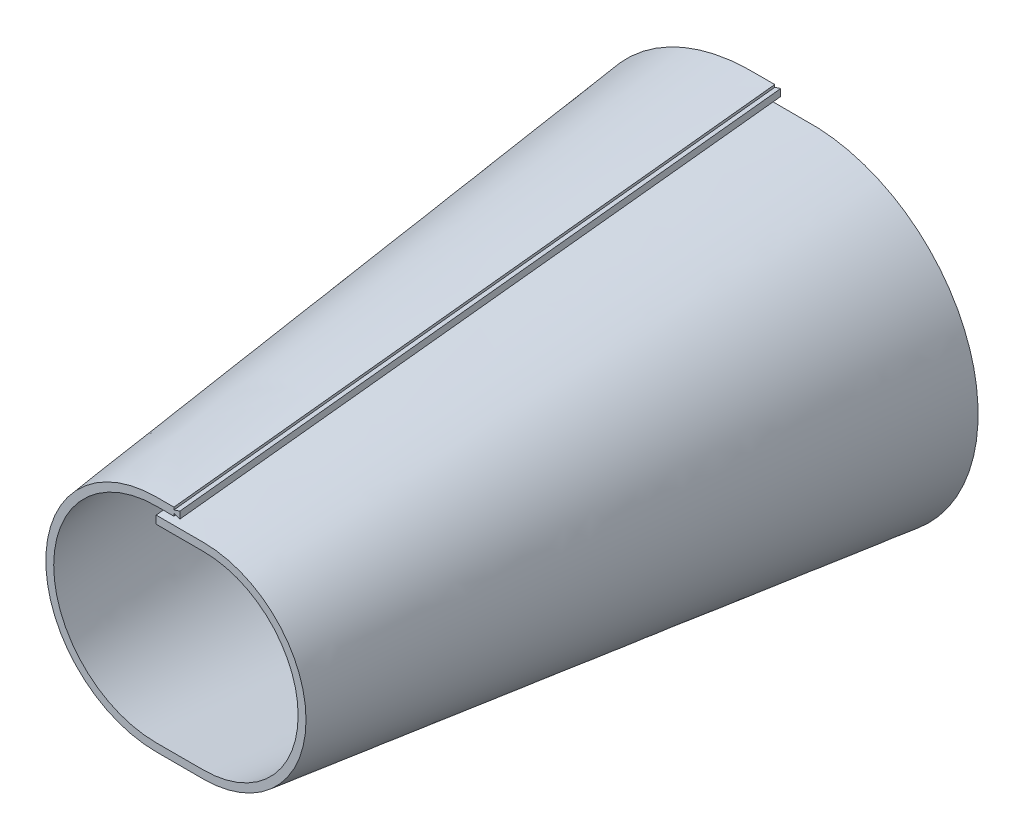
ISO-10303-21;
HEADER;
FILE_DESCRIPTION(('STEP AP214'),'2;1');
FILE_NAME('part.step','',(''),(''),'','','');
FILE_SCHEMA(('AUTOMOTIVE_DESIGN { 1 0 10303 214 1 1 1 1 }'));
ENDSEC;
DATA;
#1=APPLICATION_CONTEXT('core data for automotive mechanical design processes');
#2=APPLICATION_PROTOCOL_DEFINITION('international standard','automotive_design',2000,#1);
#3=PRODUCT_CONTEXT('',#1,'mechanical');
#4=PRODUCT('Part','Part','',(#3));
#5=PRODUCT_RELATED_PRODUCT_CATEGORY('part','',(#4));
#6=PRODUCT_DEFINITION_FORMATION('','',#4);
#7=PRODUCT_DEFINITION_CONTEXT('part definition',#1,'design');
#8=PRODUCT_DEFINITION('design','',#6,#7);
#9=PRODUCT_DEFINITION_SHAPE('','',#8);
#10=(LENGTH_UNIT() NAMED_UNIT(*) SI_UNIT(.MILLI.,.METRE.));
#11=(NAMED_UNIT(*) PLANE_ANGLE_UNIT() SI_UNIT($,.RADIAN.));
#12=(NAMED_UNIT(*) SI_UNIT($,.STERADIAN.) SOLID_ANGLE_UNIT());
#13=UNCERTAINTY_MEASURE_WITH_UNIT(LENGTH_MEASURE(1.E-05),#10,'distance_accuracy_value','');
#14=(GEOMETRIC_REPRESENTATION_CONTEXT(3) GLOBAL_UNCERTAINTY_ASSIGNED_CONTEXT((#13)) GLOBAL_UNIT_ASSIGNED_CONTEXT((#10,
#11,#12)) REPRESENTATION_CONTEXT('',''));
#15=CARTESIAN_POINT('',(0.,0.,0.));
#16=DIRECTION('',(0.,0.,1.));
#17=DIRECTION('',(1.,0.,0.));
#18=AXIS2_PLACEMENT_3D('',#15,#16,#17);
#19=CARTESIAN_POINT('',(6.,0.,0.));
#20=DIRECTION('',(0.,0.,-1.));
#21=DIRECTION('',(-1.,0.,0.));
#22=AXIS2_PLACEMENT_3D('',#19,#20,#21);
#23=PLANE('',#22);
#24=DIRECTION('',(1.,0.,0.));
#25=VECTOR('',#24,1.);
#26=CARTESIAN_POINT('',(0.,28.,0.));
#27=LINE('',#26,#25);
#28=CARTESIAN_POINT('',(-6.,28.,0.));
#29=VERTEX_POINT('',#28);
#30=CARTESIAN_POINT('',(-1.51372203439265,28.,0.));
#31=VERTEX_POINT('',#30);
#32=EDGE_CURVE('E361',#29,#31,#27,.T.);
#33=ORIENTED_EDGE('',*,*,#32,.T.);
#34=DIRECTION('',(0.,-1.,0.));
#35=VECTOR('',#34,1.);
#36=CARTESIAN_POINT('',(-1.51372203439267,0.,0.));
#37=LINE('',#36,#35);
#38=CARTESIAN_POINT('',(-1.51372203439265,28.625,0.));
#39=VERTEX_POINT('',#38);
#40=EDGE_CURVE('E259',#39,#31,#37,.T.);
#41=ORIENTED_EDGE('',*,*,#40,.F.);
#42=DIRECTION('',(-0.949058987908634,0.315098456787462,0.));
#43=VECTOR('',#42,1.);
#44=CARTESIAN_POINT('',(8.40992804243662,25.3302344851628,0.));
#45=LINE('',#44,#43);
#46=CARTESIAN_POINT('',(0.,28.1224269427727,0.));
#47=VERTEX_POINT('',#46);
#48=EDGE_CURVE('E340',#47,#39,#45,.T.);
#49=ORIENTED_EDGE('',*,*,#48,.F.);
#50=DIRECTION('',(0.,1.,0.));
#51=VECTOR('',#50,1.);
#52=CARTESIAN_POINT('',(0.,30.,0.));
#53=LINE('',#52,#51);
#54=CARTESIAN_POINT('',(0.,29.8775730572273,0.));
#55=VERTEX_POINT('',#54);
#56=EDGE_CURVE('E244',#47,#55,#53,.T.);
#57=ORIENTED_EDGE('',*,*,#56,.T.);
#58=DIRECTION('',(-0.949058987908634,-0.31509845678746,0.));
#59=VECTOR('',#58,1.);
#60=CARTESIAN_POINT('',(0.,29.8775730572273,0.));
#61=LINE('',#60,#59);
#62=CARTESIAN_POINT('',(-1.51372203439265,29.375,0.));
#63=VERTEX_POINT('',#62);
#64=EDGE_CURVE('E684',#55,#63,#61,.T.);
#65=ORIENTED_EDGE('',*,*,#64,.T.);
#66=DIRECTION('',(0.,-1.,0.));
#67=VECTOR('',#66,1.);
#68=CARTESIAN_POINT('',(-1.51372203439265,30.,0.));
#69=LINE('',#68,#67);
#70=CARTESIAN_POINT('',(-1.51372203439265,30.,0.));
#71=VERTEX_POINT('',#70);
#72=EDGE_CURVE('E686',#71,#63,#69,.T.);
#73=ORIENTED_EDGE('',*,*,#72,.F.);
#74=DIRECTION('',(-1.,0.,0.));
#75=VECTOR('',#74,1.);
#76=CARTESIAN_POINT('',(-6.,30.,0.));
#77=LINE('',#76,#75);
#78=CARTESIAN_POINT('',(-6.00000000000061,30.,0.));
#79=VERTEX_POINT('',#78);
#80=EDGE_CURVE('E360',#71,#79,#77,.T.);
#81=ORIENTED_EDGE('',*,*,#80,.T.);
#82=CARTESIAN_POINT('',(-6.,2.,0.));
#83=DIRECTION('',(0.,0.,1.));
#84=DIRECTION('',(-1.,0.,0.));
#85=AXIS2_PLACEMENT_3D('',#82,#83,#84);
#86=CIRCLE('',#85,28.);
#87=CARTESIAN_POINT('',(-6.00000000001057,-26.,0.));
#88=VERTEX_POINT('',#87);
#89=EDGE_CURVE('E742',#79,#88,#86,.T.);
#90=ORIENTED_EDGE('',*,*,#89,.T.);
#91=DIRECTION('',(1.,0.,0.));
#92=VECTOR('',#91,1.);
#93=CARTESIAN_POINT('',(-6.,-26.,0.));
#94=LINE('',#93,#92);
#95=CARTESIAN_POINT('',(6.00000000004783,-26.,0.));
#96=VERTEX_POINT('',#95);
#97=EDGE_CURVE('E757',#88,#96,#94,.T.);
#98=ORIENTED_EDGE('',*,*,#97,.T.);
#99=CARTESIAN_POINT('',(6.,0.,0.));
#100=DIRECTION('',(0.,0.,1.));
#101=DIRECTION('',(-1.,0.,0.));
#102=AXIS2_PLACEMENT_3D('',#99,#100,#101);
#103=CIRCLE('',#102,26.);
#104=CARTESIAN_POINT('',(6.,26.,0.));
#105=VERTEX_POINT('',#104);
#106=EDGE_CURVE('E779',#96,#105,#103,.T.);
#107=ORIENTED_EDGE('',*,*,#106,.T.);
#108=DIRECTION('',(-1.,0.,0.));
#109=VECTOR('',#108,1.);
#110=CARTESIAN_POINT('',(-6.,26.,0.));
#111=LINE('',#110,#109);
#112=CARTESIAN_POINT('',(-6.,26.,0.));
#113=VERTEX_POINT('',#112);
#114=EDGE_CURVE('E528',#105,#113,#111,.T.);
#115=ORIENTED_EDGE('',*,*,#114,.T.);
#116=DIRECTION('',(0.,-1.,0.));
#117=VECTOR('',#116,1.);
#118=CARTESIAN_POINT('',(-6.,26.,0.));
#119=LINE('',#118,#117);
#120=CARTESIAN_POINT('',(-6.,24.,0.));
#121=VERTEX_POINT('',#120);
#122=EDGE_CURVE('E501',#113,#121,#119,.T.);
#123=ORIENTED_EDGE('',*,*,#122,.T.);
#124=DIRECTION('',(1.,0.,0.));
#125=VECTOR('',#124,1.);
#126=CARTESIAN_POINT('',(-6.,24.,0.));
#127=LINE('',#126,#125);
#128=CARTESIAN_POINT('',(6.00000000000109,24.,0.));
#129=VERTEX_POINT('',#128);
#130=EDGE_CURVE('E491',#121,#129,#127,.T.);
#131=ORIENTED_EDGE('',*,*,#130,.T.);
#132=CARTESIAN_POINT('',(6.,0.,0.));
#133=DIRECTION('',(0.,0.,-1.));
#134=DIRECTION('',(-1.,0.,0.));
#135=AXIS2_PLACEMENT_3D('',#132,#133,#134);
#136=CIRCLE('',#135,24.);
#137=CARTESIAN_POINT('',(6.00000000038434,-24.,0.));
#138=VERTEX_POINT('',#137);
#139=EDGE_CURVE('E482',#129,#138,#136,.T.);
#140=ORIENTED_EDGE('',*,*,#139,.T.);
#141=DIRECTION('',(-1.,0.,0.));
#142=VECTOR('',#141,1.);
#143=CARTESIAN_POINT('',(6.,-24.,0.));
#144=LINE('',#143,#142);
#145=CARTESIAN_POINT('',(-6.00000000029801,-24.,0.));
#146=VERTEX_POINT('',#145);
#147=EDGE_CURVE('E461',#138,#146,#144,.T.);
#148=ORIENTED_EDGE('',*,*,#147,.T.);
#149=CARTESIAN_POINT('',(-5.99999999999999,2.,0.));
#150=DIRECTION('',(0.,0.,-1.));
#151=DIRECTION('',(-1.,0.,0.));
#152=AXIS2_PLACEMENT_3D('',#149,#150,#151);
#153=CIRCLE('',#152,26.);
#154=EDGE_CURVE('E438',#146,#29,#153,.T.);
#155=ORIENTED_EDGE('',*,*,#154,.T.);
#156=EDGE_LOOP('',(#33,#41,#49,#57,#65,#73,#81,#90,#98,#107,#115,#123,#131,#140,#148,#155));
#157=FACE_BOUND('',#156,.T.);
#158=ADVANCED_FACE('F240',(#157),#23,.F.);
#159=CARTESIAN_POINT('',(0.,50.1738488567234,-203.2));
#160=DIRECTION('',(1.,0.,0.));
#161=DIRECTION('',(0.,1.,0.));
#162=AXIS2_PLACEMENT_3D('',#159,#160,#161);
#163=PLANE('',#162);
#164=DIRECTION('',(0.,-0.10847930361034,0.994098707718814));
#165=VECTOR('',#164,1.);
#166=CARTESIAN_POINT('',(0.,50.1654214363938,-202.000857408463));
#167=LINE('',#166,#165);
#168=CARTESIAN_POINT('',(0.,44.7528135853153,-152.4));
#169=VERTEX_POINT('',#168);
#170=EDGE_CURVE('E336',#169,#47,#167,.T.);
#171=ORIENTED_EDGE('',*,*,#170,.F.);
#172=DIRECTION('',(0.,-1.,0.));
#173=VECTOR('',#172,1.);
#174=CARTESIAN_POINT('',(0.,50.1738488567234,-152.4));
#175=LINE('',#174,#173);
#176=CARTESIAN_POINT('',(0.,46.5079596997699,-152.4));
#177=VERTEX_POINT('',#176);
#178=EDGE_CURVE('E833',#177,#169,#175,.T.);
#179=ORIENTED_EDGE('',*,*,#178,.F.);
#180=DIRECTION('',(0.,-0.10847930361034,0.994098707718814));
#181=VECTOR('',#180,1.);
#182=CARTESIAN_POINT('',(0.,51.9205675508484,-202.000857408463));
#183=LINE('',#182,#181);
#184=EDGE_CURVE('E358',#177,#55,#183,.T.);
#185=ORIENTED_EDGE('',*,*,#184,.T.);
#186=ORIENTED_EDGE('',*,*,#56,.F.);
#187=EDGE_LOOP('',(#171,#179,#185,#186));
#188=FACE_BOUND('',#187,.T.);
#189=ADVANCED_FACE('F357',(#188),#163,.T.);
#190=CARTESIAN_POINT('',(0.,0.,-152.4));
#191=DIRECTION('',(0.,0.,1.));
#192=DIRECTION('',(1.,0.,0.));
#193=AXIS2_PLACEMENT_3D('',#190,#191,#192);
#194=PLANE('',#193);
#195=DIRECTION('',(-0.949058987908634,0.315098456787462,0.));
#196=VECTOR('',#195,1.);
#197=CARTESIAN_POINT('',(13.3831956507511,40.3094393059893,-152.4));
#198=LINE('',#197,#196);
#199=CARTESIAN_POINT('',(-1.51372203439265,45.2553866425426,-152.4));
#200=VERTEX_POINT('',#199);
#201=EDGE_CURVE('E12',#169,#200,#198,.T.);
#202=ORIENTED_EDGE('',*,*,#201,.T.);
#203=DIRECTION('',(0.,-1.,0.));
#204=VECTOR('',#203,1.);
#205=CARTESIAN_POINT('',(-1.51372203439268,0.,-152.4));
#206=LINE('',#205,#204);
#207=CARTESIAN_POINT('',(-1.51372203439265,44.6303866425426,-152.4));
#208=VERTEX_POINT('',#207);
#209=EDGE_CURVE('E672',#200,#208,#206,.T.);
#210=ORIENTED_EDGE('',*,*,#209,.T.);
#211=DIRECTION('',(-1.,0.,0.));
#212=VECTOR('',#211,1.);
#213=CARTESIAN_POINT('',(-8.03280693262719,44.6303866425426,-152.4));
#214=LINE('',#213,#212);
#215=CARTESIAN_POINT('',(-7.52460519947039,44.6303866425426,-152.4));
#216=VERTEX_POINT('',#215);
#217=EDGE_CURVE('E457',#208,#216,#214,.T.);
#218=ORIENTED_EDGE('',*,*,#217,.T.);
#219=CARTESIAN_POINT('',(-7.52460519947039,44.6303866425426,-152.4));
#220=CARTESIAN_POINT('',(-8.42487105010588,44.6303852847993,-152.4));
#221=CARTESIAN_POINT('',(-9.32512352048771,44.6017447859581,-152.4));
#222=CARTESIAN_POINT('',(-11.1220588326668,44.4875533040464,-152.4));
#223=CARTESIAN_POINT('',(-12.0187414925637,44.4019994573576,-152.4));
#224=CARTESIAN_POINT('',(-13.8049317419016,44.1743454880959,-152.4));
#225=CARTESIAN_POINT('',(-14.6944390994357,44.0322435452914,-152.4));
#226=CARTESIAN_POINT('',(-16.4608476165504,43.6921768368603,-152.4));
#227=CARTESIAN_POINT('',(-17.3377706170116,43.4943255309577,-152.4));
#228=CARTESIAN_POINT('',(-19.0772952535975,43.0436585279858,-152.4));
#229=CARTESIAN_POINT('',(-19.9398979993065,42.7908471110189,-152.4));
#230=CARTESIAN_POINT('',(-21.6473250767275,42.2312991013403,-152.4));
#231=CARTESIAN_POINT('',(-22.4921518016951,41.9245698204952,-152.4));
#232=CARTESIAN_POINT('',(-24.0680540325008,41.2950978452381,-152.4));
#233=CARTESIAN_POINT('',(-24.8013526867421,40.9779051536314,-152.4));
#234=CARTESIAN_POINT('',(-26.2489150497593,40.3028071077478,-152.4));
#235=CARTESIAN_POINT('',(-26.9631799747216,39.944904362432,-152.4));
#236=CARTESIAN_POINT('',(-28.3705008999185,39.1896196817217,-152.4));
#237=CARTESIAN_POINT('',(-29.0635573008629,38.7922384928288,-152.4));
#238=CARTESIAN_POINT('',(-30.425993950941,37.9593122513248,-152.4));
#239=CARTESIAN_POINT('',(-31.0953829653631,37.5237815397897,-152.4));
#240=CARTESIAN_POINT('',(-32.4086105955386,36.6157649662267,-152.4));
#241=CARTESIAN_POINT('',(-33.0524489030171,36.1432786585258,-152.4));
#242=CARTESIAN_POINT('',(-34.3126412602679,35.1629445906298,-152.4));
#243=CARTESIAN_POINT('',(-34.9289954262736,34.6550969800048,-152.4));
#244=CARTESIAN_POINT('',(-35.9819911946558,33.7366500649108,-152.4));
#245=CARTESIAN_POINT('',(-36.425086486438,33.3334209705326,-152.4));
#246=CARTESIAN_POINT('',(-37.2938603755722,32.508549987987,-152.4));
#247=CARTESIAN_POINT('',(-37.7195379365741,32.0869070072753,-152.4));
#248=CARTESIAN_POINT('',(-38.5526648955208,31.2259937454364,-152.4));
#249=CARTESIAN_POINT('',(-38.9601147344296,30.7867238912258,-152.4));
#250=CARTESIAN_POINT('',(-39.7561162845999,29.8914417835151,-152.4));
#251=CARTESIAN_POINT('',(-40.1446682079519,29.4354297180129,-152.4));
#252=CARTESIAN_POINT('',(-41.2811439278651,28.0433104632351,-152.4));
#253=CARTESIAN_POINT('',(-41.999894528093,27.0831131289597,-152.4));
#254=CARTESIAN_POINT('',(-43.3537679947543,25.1054636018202,-152.4));
#255=CARTESIAN_POINT('',(-43.9888906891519,24.0880112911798,-152.4));
#256=CARTESIAN_POINT('',(-44.8753790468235,22.5251071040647,-152.4));
#257=CARTESIAN_POINT('',(-45.1597820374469,21.9981493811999,-152.4));
#258=CARTESIAN_POINT('',(-45.7061775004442,20.9327007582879,-152.4));
#259=CARTESIAN_POINT('',(-45.9681700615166,20.3942099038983,-152.4));
#260=CARTESIAN_POINT('',(-46.4691908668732,19.3066612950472,-152.4));
#261=CARTESIAN_POINT('',(-46.7082192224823,18.7576035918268,-152.4));
#262=CARTESIAN_POINT('',(-47.1628166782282,17.6498572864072,-152.4));
#263=CARTESIAN_POINT('',(-47.3783857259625,17.0911686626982,-152.4));
#264=CARTESIAN_POINT('',(-47.7857596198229,15.9652649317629,-152.4));
#265=CARTESIAN_POINT('',(-47.977567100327,15.3980507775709,-152.4));
#266=CARTESIAN_POINT('',(-48.3371453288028,14.2560600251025,-152.4));
#267=CARTESIAN_POINT('',(-48.5049161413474,13.6812834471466,-152.4));
#268=CARTESIAN_POINT('',(-48.8161340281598,12.5251627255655,-152.4));
#269=CARTESIAN_POINT('',(-48.9595809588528,11.943818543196,-152.4));
#270=CARTESIAN_POINT('',(-49.2218218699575,10.7756447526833,-152.4));
#271=CARTESIAN_POINT('',(-49.3406155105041,10.1888150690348,-152.4));
#272=CARTESIAN_POINT('',(-49.6597124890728,8.42143394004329,-152.4));
#273=CARTESIAN_POINT('',(-49.8227734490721,7.23383598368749,-152.4));
#274=CARTESIAN_POINT('',(-49.9920504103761,5.44590252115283,-152.4));
#275=CARTESIAN_POINT('',(-50.0359239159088,4.84880967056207,-152.4));
#276=CARTESIAN_POINT('',(-50.0984891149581,3.65309777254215,-152.4));
#277=CARTESIAN_POINT('',(-50.1171745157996,3.054478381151,-152.4));
#278=CARTESIAN_POINT('',(-50.1291845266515,1.85703057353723,-152.4));
#279=CARTESIAN_POINT('',(-50.1225104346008,1.25820216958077,-152.4));
#280=CARTESIAN_POINT('',(-50.0838799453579,0.0613035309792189,-152.4));
#281=CARTESIAN_POINT('',(-50.0519212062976,-0.536766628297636,-152.4));
#282=CARTESIAN_POINT('',(-49.9628541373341,-1.73101777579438,-152.4));
#283=CARTESIAN_POINT('',(-49.9057463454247,-2.32719880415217,-152.4));
#284=CARTESIAN_POINT('',(-49.7665019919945,-3.51660783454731,-152.4));
#285=CARTESIAN_POINT('',(-49.6843662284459,-4.10983593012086,-152.4));
#286=CARTESIAN_POINT('',(-49.4951352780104,-5.29255623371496,-152.4));
#287=CARTESIAN_POINT('',(-49.388030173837,-5.88204686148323,-152.4));
#288=CARTESIAN_POINT('',(-49.1490207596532,-7.05593982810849,-152.4));
#289=CARTESIAN_POINT('',(-49.0171156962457,-7.64034201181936,-152.4));
#290=CARTESIAN_POINT('',(-48.5846220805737,-9.3844492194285,-152.4));
#291=CARTESIAN_POINT('',(-48.2472083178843,-10.5353468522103,-152.4));
#292=CARTESIAN_POINT('',(-47.6695790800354,-12.236724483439,-152.4));
#293=CARTESIAN_POINT('',(-47.4651255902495,-12.7996712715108,-152.4));
#294=CARTESIAN_POINT('',(-47.0326084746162,-13.9164286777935,-152.4));
#295=CARTESIAN_POINT('',(-46.8045453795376,-14.470239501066,-152.4));
#296=CARTESIAN_POINT('',(-46.0855376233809,-16.1163967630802,-152.4));
#297=CARTESIAN_POINT('',(-45.5596935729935,-17.1937063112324,-152.4));
#298=CARTESIAN_POINT('',(-44.4197264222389,-19.2995991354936,-152.4));
#299=CARTESIAN_POINT('',(-43.8056648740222,-20.328215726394,-152.4));
#300=CARTESIAN_POINT('',(-42.8213791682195,-21.8293734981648,-152.4));
#301=CARTESIAN_POINT('',(-42.4827102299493,-22.3228511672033,-152.4));
#302=CARTESIAN_POINT('',(-41.7848609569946,-23.2951289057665,-152.4));
#303=CARTESIAN_POINT('',(-41.425680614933,-23.773928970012,-152.4));
#304=CARTESIAN_POINT('',(-40.6872063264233,-24.716383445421,-152.4));
#305=CARTESIAN_POINT('',(-40.3078960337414,-25.1800250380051,-152.4));
#306=CARTESIAN_POINT('',(-39.5300852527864,-26.0909366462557,-152.4));
#307=CARTESIAN_POINT('',(-39.1315844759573,-26.5382064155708,-152.4));
#308=CARTESIAN_POINT('',(-38.3160519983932,-27.4155434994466,-152.4));
#309=CARTESIAN_POINT('',(-37.8990199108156,-27.8456104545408,-152.4));
#310=CARTESIAN_POINT('',(-37.0471514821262,-28.6876562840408,-152.4));
#311=CARTESIAN_POINT('',(-36.6123163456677,-29.0996363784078,-152.4));
#312=CARTESIAN_POINT('',(-35.5775363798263,-30.0394058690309,-152.4));
#313=CARTESIAN_POINT('',(-34.9709547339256,-30.5599150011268,-152.4));
#314=CARTESIAN_POINT('',(-33.7295422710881,-31.5660757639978,-152.4));
#315=CARTESIAN_POINT('',(-33.0947110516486,-32.051726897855,-152.4));
#316=CARTESIAN_POINT('',(-31.7987797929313,-32.9865722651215,-152.4));
#317=CARTESIAN_POINT('',(-31.1376794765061,-33.4357661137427,-152.4));
#318=CARTESIAN_POINT('',(-29.4562892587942,-34.510272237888,-152.4));
#319=CARTESIAN_POINT('',(-28.4208667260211,-35.1120816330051,-152.4));
#320=CARTESIAN_POINT('',(-26.3031763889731,-36.2266367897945,-152.4));
#321=CARTESIAN_POINT('',(-25.2209119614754,-36.7393889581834,-152.4));
#322=CARTESIAN_POINT('',(-23.5674068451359,-37.4388704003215,-152.4));
#323=CARTESIAN_POINT('',(-23.0107356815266,-37.6605814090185,-152.4));
#324=CARTESIAN_POINT('',(-21.8884779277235,-38.0803036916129,-152.4));
#325=CARTESIAN_POINT('',(-21.3228911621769,-38.2783144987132,-152.4));
#326=CARTESIAN_POINT('',(-20.1838393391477,-38.650346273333,-152.4));
#327=CARTESIAN_POINT('',(-19.6103736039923,-38.8243651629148,-152.4));
#328=CARTESIAN_POINT('',(-18.4565340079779,-39.1481241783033,-152.4));
#329=CARTESIAN_POINT('',(-17.8761591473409,-39.2978607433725,-152.4));
#330=CARTESIAN_POINT('',(-16.7093712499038,-39.5727753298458,-152.4));
#331=CARTESIAN_POINT('',(-16.1229557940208,-39.6979430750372,-152.4));
#332=CARTESIAN_POINT('',(-14.9453615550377,-39.9233512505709,-152.4));
#333=CARTESIAN_POINT('',(-14.3541830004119,-40.0235928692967,-152.4));
#334=CARTESIAN_POINT('',(-13.4647762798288,-40.1551733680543,-152.4));
#335=CARTESIAN_POINT('',(-13.1679071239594,-40.1958990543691,-152.4));
#336=CARTESIAN_POINT('',(-12.5733738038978,-40.2710865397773,-152.4));
#337=CARTESIAN_POINT('',(-12.2757096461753,-40.3055483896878,-152.4));
#338=CARTESIAN_POINT('',(-11.679907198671,-40.3681750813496,-152.4));
#339=CARTESIAN_POINT('',(-11.3817693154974,-40.3963438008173,-152.4));
#340=CARTESIAN_POINT('',(-10.7849606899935,-40.4463986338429,-152.4));
#341=CARTESIAN_POINT('',(-10.48628993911,-40.4682846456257,-152.4));
#342=CARTESIAN_POINT('',(-9.95309771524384,-40.5017131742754,-152.4));
#343=CARTESIAN_POINT('',(-9.71865180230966,-40.5144687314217,-152.4));
#344=CARTESIAN_POINT('',(-9.36685773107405,-40.5306936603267,-152.4));
#345=CARTESIAN_POINT('',(-9.24957527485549,-40.5356171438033,-152.4));
#346=CARTESIAN_POINT('',(-9.01497263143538,-40.5444940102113,-152.4));
#347=CARTESIAN_POINT('',(-8.89765244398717,-40.5484473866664,-152.4));
#348=CARTESIAN_POINT('',(-8.66297338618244,-40.5553837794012,-152.4));
#349=CARTESIAN_POINT('',(-8.54561451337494,-40.5583667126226,-152.4));
#350=CARTESIAN_POINT('',(-8.3108777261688,-40.5633596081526,-152.4));
#351=CARTESIAN_POINT('',(-8.19349981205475,-40.5653695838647,-152.4));
#352=CARTESIAN_POINT('',(-7.95872526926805,-40.5684206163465,-152.4));
#353=CARTESIAN_POINT('',(-7.84132863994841,-40.5694616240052,-152.4));
#354=CARTESIAN_POINT('',(-7.66522985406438,-40.5702823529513,-152.4));
#355=CARTESIAN_POINT('',(-7.60652922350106,-40.5704324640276,-152.4));
#356=CARTESIAN_POINT('',(-7.51847813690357,-40.570489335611,-152.4));
#357=CARTESIAN_POINT('',(-7.48912770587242,-40.5704802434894,-152.4));
#358=CARTESIAN_POINT('',(-7.43042684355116,-40.5704732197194,-152.4));
#359=CARTESIAN_POINT('',(-7.40107641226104,-40.5704752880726,-152.4));
#360=CARTESIAN_POINT('',(-7.254279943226,-40.5704825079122,-152.4));
#361=CARTESIAN_POINT('',(-7.13683390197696,-40.5704782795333,-152.4));
#362=CARTESIAN_POINT('',(-6.90194255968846,-40.5704751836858,-152.4));
#363=CARTESIAN_POINT('',(-6.78449725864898,-40.5704763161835,-152.4));
#364=CARTESIAN_POINT('',(-6.54960907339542,-40.5704771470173,-152.4));
#365=CARTESIAN_POINT('',(-6.43216618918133,-40.5704768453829,-152.4));
#366=CARTESIAN_POINT('',(-6.19728022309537,-40.5704766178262,-152.4));
#367=CARTESIAN_POINT('',(-6.0798371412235,-40.5704766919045,-152.4));
#368=CARTESIAN_POINT('',(-5.72748908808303,-40.5704768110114,-152.4));
#369=CARTESIAN_POINT('',(-5.4925841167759,-40.570476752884,-152.4));
#370=CARTESIAN_POINT('',(-5.02277273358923,-40.5704767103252,-152.4));
#371=CARTESIAN_POINT('',(-4.78786632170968,-40.5704767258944,-152.4));
#372=CARTESIAN_POINT('',(-4.3181066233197,-40.5704767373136,-152.4));
#373=CARTESIAN_POINT('',(-4.08325333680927,-40.5704767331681,-152.4));
#374=CARTESIAN_POINT('',(-3.6135471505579,-40.5704767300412,-152.4));
#375=CARTESIAN_POINT('',(-3.37869425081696,-40.5704767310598,-152.4));
#376=CARTESIAN_POINT('',(-2.67196533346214,-40.5704767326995,-152.4));
#377=CARTESIAN_POINT('',(-2.20008931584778,-40.5704767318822,-152.4));
#378=CARTESIAN_POINT('',(-1.25645764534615,-40.5704767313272,-152.4));
#379=CARTESIAN_POINT('',(-0.784701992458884,-40.5704767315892,-152.4));
#380=CARTESIAN_POINT('',(0.158843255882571,-40.5704767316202,-152.4));
#381=CARTESIAN_POINT('',(0.630632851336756,-40.5704767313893,-152.4));
#382=CARTESIAN_POINT('',(1.5744002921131,-40.5704767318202,-152.4));
#383=CARTESIAN_POINT('',(2.04637813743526,-40.5704767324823,-152.4));
#384=CARTESIAN_POINT('',(2.99067638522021,-40.5704767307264,-152.4));
#385=CARTESIAN_POINT('',(3.46299678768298,-40.5704767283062,-152.4));
#386=CARTESIAN_POINT('',(4.19055021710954,-40.5704767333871,-152.4));
#387=CARTESIAN_POINT('',(4.44578324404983,-40.5704767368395,-152.4));
#388=CARTESIAN_POINT('',(4.95624714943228,-40.5704767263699,-152.4));
#389=CARTESIAN_POINT('',(5.21147802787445,-40.5704767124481,-152.4));
#390=CARTESIAN_POINT('',(5.59439294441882,-40.5704767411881,-152.4));
#391=CARTESIAN_POINT('',(5.72207698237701,-40.57047675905,-152.4));
#392=CARTESIAN_POINT('',(5.97744492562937,-40.5704767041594,-152.4));
#393=CARTESIAN_POINT('',(6.10512883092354,-40.570476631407,-152.4));
#394=CARTESIAN_POINT('',(6.36050051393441,-40.5704768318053,-152.4));
#395=CARTESIAN_POINT('',(6.48818829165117,-40.5704771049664,-152.4));
#396=CARTESIAN_POINT('',(6.74356433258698,-40.5704763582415,-152.4));
#397=CARTESIAN_POINT('',(6.87125259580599,-40.5704753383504,-152.4));
#398=CARTESIAN_POINT('',(7.0627611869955,-40.5704774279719,-152.4));
#399=CARTESIAN_POINT('',(7.12658150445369,-40.5704787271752,-152.4));
#400=CARTESIAN_POINT('',(7.25422219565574,-40.5704747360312,-152.4));
#401=CARTESIAN_POINT('',(7.31804256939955,-40.570469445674,-152.4));
#402=CARTESIAN_POINT('',(7.44568298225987,-40.5704840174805,-152.4));
#403=CARTESIAN_POINT('',(7.50950302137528,-40.5705038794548,-152.4));
#404=CARTESIAN_POINT('',(7.63714229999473,-40.5702125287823,-152.4));
#405=CARTESIAN_POINT('',(7.70096153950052,-40.5699013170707,-152.4));
#406=CARTESIAN_POINT('',(7.89240793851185,-40.5685229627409,-152.4));
#407=CARTESIAN_POINT('',(8.02003212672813,-40.5670111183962,-152.4));
#408=CARTESIAN_POINT('',(8.27526187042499,-40.5627756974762,-152.4));
#409=CARTESIAN_POINT('',(8.40286742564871,-40.5600521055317,-152.4));
#410=CARTESIAN_POINT('',(8.65788545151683,-40.553405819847,-152.4));
#411=CARTESIAN_POINT('',(8.78529796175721,-40.5494846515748,-152.4));
#412=CARTESIAN_POINT('',(9.04007921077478,-40.5404413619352,-152.4));
#413=CARTESIAN_POINT('',(9.1674479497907,-40.5353192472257,-152.4));
#414=CARTESIAN_POINT('',(9.54949174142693,-40.518153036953,-152.4));
#415=CARTESIAN_POINT('',(9.80408837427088,-40.5043094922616,-152.4));
#416=CARTESIAN_POINT('',(10.3128271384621,-40.4718427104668,-152.4));
#417=CARTESIAN_POINT('',(10.5669694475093,-40.4532222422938,-152.4));
#418=CARTESIAN_POINT('',(11.0748514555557,-40.4112075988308,-152.4));
#419=CARTESIAN_POINT('',(11.3285911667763,-40.3878135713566,-152.4));
#420=CARTESIAN_POINT('',(11.8356457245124,-40.3362544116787,-152.4));
#421=CARTESIAN_POINT('',(12.0889604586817,-40.3080881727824,-152.4));
#422=CARTESIAN_POINT('',(12.5950149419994,-40.2469973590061,-152.4));
#423=CARTESIAN_POINT('',(12.8477546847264,-40.2140727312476,-152.4));
#424=CARTESIAN_POINT('',(13.5985702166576,-40.1090718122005,-152.4));
#425=CARTESIAN_POINT('',(14.0957018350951,-40.0301100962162,-152.4));
#426=CARTESIAN_POINT('',(15.0874667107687,-39.8535853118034,-152.4));
#427=CARTESIAN_POINT('',(15.58209463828,-39.7559924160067,-152.4));
#428=CARTESIAN_POINT('',(16.5679097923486,-39.5423092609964,-152.4));
#429=CARTESIAN_POINT('',(17.0590926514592,-39.4261988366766,-152.4));
#430=CARTESIAN_POINT('',(18.0370828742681,-39.1756969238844,-152.4));
#431=CARTESIAN_POINT('',(18.5238874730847,-39.0412946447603,-152.4));
#432=CARTESIAN_POINT('',(19.4921979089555,-38.7544403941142,-152.4));
#433=CARTESIAN_POINT('',(19.9737032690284,-38.6019868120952,-152.4));
#434=CARTESIAN_POINT('',(20.9304960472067,-38.2793074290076,-152.4));
#435=CARTESIAN_POINT('',(21.4057859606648,-38.1090890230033,-152.4));
#436=CARTESIAN_POINT('',(22.4097053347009,-37.728230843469,-152.4));
#437=CARTESIAN_POINT('',(22.9374310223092,-37.5152035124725,-152.4));
#438=CARTESIAN_POINT('',(23.982949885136,-37.0672900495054,-152.4));
#439=CARTESIAN_POINT('',(24.5007516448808,-36.8324239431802,-152.4));
#440=CARTESIAN_POINT('',(25.5258011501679,-36.3412933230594,-152.4));
#441=CARTESIAN_POINT('',(26.03305382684,-36.0850391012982,-152.4));
#442=CARTESIAN_POINT('',(27.0363466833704,-35.551524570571,-152.4));
#443=CARTESIAN_POINT('',(27.5323875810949,-35.2742656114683,-152.4));
#444=CARTESIAN_POINT('',(28.5163422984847,-34.6969051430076,-152.4));
#445=CARTESIAN_POINT('',(29.0041592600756,-34.3966385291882,-152.4));
#446=CARTESIAN_POINT('',(29.9667715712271,-33.7756185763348,-152.4));
#447=CARTESIAN_POINT('',(30.4415631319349,-33.4548593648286,-152.4));
#448=CARTESIAN_POINT('',(31.3772236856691,-32.7934873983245,-152.4));
#449=CARTESIAN_POINT('',(31.8380905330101,-32.4528716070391,-152.4));
#450=CARTESIAN_POINT('',(32.7450225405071,-31.7524826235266,-152.4));
#451=CARTESIAN_POINT('',(33.1910874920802,-31.3927091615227,-152.4));
#452=CARTESIAN_POINT('',(34.2123434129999,-30.5327761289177,-152.4));
#453=CARTESIAN_POINT('',(34.7815503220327,-30.025479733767,-152.4));
#454=CARTESIAN_POINT('',(35.8903460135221,-28.9796285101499,-152.4));
#455=CARTESIAN_POINT('',(36.429937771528,-28.441076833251,-152.4));
#456=CARTESIAN_POINT('',(37.4778730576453,-27.3344073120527,-152.4));
#457=CARTESIAN_POINT('',(37.986217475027,-26.7662903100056,-152.4));
#458=CARTESIAN_POINT('',(38.9686507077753,-25.6042351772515,-152.4));
#459=CARTESIAN_POINT('',(39.4428418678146,-25.010383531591,-152.4));
#460=CARTESIAN_POINT('',(40.3572295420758,-23.7970055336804,-152.4));
#461=CARTESIAN_POINT('',(40.7974250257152,-23.1774784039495,-152.4));
#462=CARTESIAN_POINT('',(41.6422699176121,-21.9147164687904,-152.4));
#463=CARTESIAN_POINT('',(42.0469189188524,-21.2714813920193,-152.4));
#464=CARTESIAN_POINT('',(43.0132649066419,-19.6353527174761,-152.4));
#465=CARTESIAN_POINT('',(43.5520641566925,-18.6287464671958,-152.4));
#466=CARTESIAN_POINT('',(44.2951683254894,-17.0879084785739,-152.4));
#467=CARTESIAN_POINT('',(44.5320428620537,-16.5690828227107,-152.4));
#468=CARTESIAN_POINT('',(44.9836542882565,-15.5218450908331,-152.4));
#469=CARTESIAN_POINT('',(45.1983915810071,-14.9934331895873,-152.4));
#470=CARTESIAN_POINT('',(45.6055762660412,-13.9274784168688,-152.4));
#471=CARTESIAN_POINT('',(45.7980007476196,-13.3899267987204,-152.4));
#472=CARTESIAN_POINT('',(46.1600374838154,-12.3072253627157,-152.4));
#473=CARTESIAN_POINT('',(46.3296495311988,-11.7620754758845,-152.4));
#474=CARTESIAN_POINT('',(46.8038248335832,-10.1166801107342,-152.4));
#475=CARTESIAN_POINT('',(47.0738142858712,-9.00626090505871,-152.4));
#476=CARTESIAN_POINT('',(47.5190640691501,-6.76669512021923,-152.4));
#477=CARTESIAN_POINT('',(47.6943330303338,-5.63755025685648,-152.4));
#478=CARTESIAN_POINT('',(47.8855887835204,-3.93606545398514,-152.4));
#479=CARTESIAN_POINT('',(47.9374011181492,-3.36754840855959,-152.4));
#480=CARTESIAN_POINT('',(48.0170415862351,-2.22880286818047,-152.4));
#481=CARTESIAN_POINT('',(48.0448698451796,-1.65857438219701,-152.4));
#482=CARTESIAN_POINT('',(48.0763978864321,-0.517560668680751,-152.4));
#483=CARTESIAN_POINT('',(48.0801019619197,0.0532244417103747,-152.4));
#484=CARTESIAN_POINT('',(48.0633517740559,1.19444327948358,-152.4));
#485=CARTESIAN_POINT('',(48.0428974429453,1.76487700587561,-152.4));
#486=CARTESIAN_POINT('',(47.9779745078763,2.90437839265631,-152.4));
#487=CARTESIAN_POINT('',(47.9335057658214,3.47344604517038,-152.4));
#488=CARTESIAN_POINT('',(47.8206616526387,4.60920343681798,-152.4));
#489=CARTESIAN_POINT('',(47.7522862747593,5.1758931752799,-152.4));
#490=CARTESIAN_POINT('',(47.5917245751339,6.30603692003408,-152.4));
#491=CARTESIAN_POINT('',(47.4995326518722,6.86949013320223,-152.4));
#492=CARTESIAN_POINT('',(47.2914453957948,7.99196109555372,-152.4));
#493=CARTESIAN_POINT('',(47.175550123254,8.55097885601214,-152.4));
#494=CARTESIAN_POINT('',(46.7926473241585,10.219913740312,-152.4));
#495=CARTESIAN_POINT('',(46.4903862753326,11.3219693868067,-152.4));
#496=CARTESIAN_POINT('',(45.7944646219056,13.4962253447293,-152.4));
#497=CARTESIAN_POINT('',(45.4008347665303,14.5684355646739,-152.4));
#498=CARTESIAN_POINT('',(44.5242156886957,16.6759037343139,-152.4));
#499=CARTESIAN_POINT('',(44.0412264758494,17.7111616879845,-152.4));
#500=CARTESIAN_POINT('',(43.2531417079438,19.2301474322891,-152.4));
#501=CARTESIAN_POINT('',(42.9799374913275,19.7306817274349,-152.4));
#502=CARTESIAN_POINT('',(42.4127153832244,20.7198606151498,-152.4));
#503=CARTESIAN_POINT('',(42.1186975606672,21.2085052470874,-152.4));
#504=CARTESIAN_POINT('',(41.5103435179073,22.1729706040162,-152.4));
#505=CARTESIAN_POINT('',(41.1960071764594,22.6487912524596,-152.4));
#506=CARTESIAN_POINT('',(40.5475403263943,23.5867491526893,-152.4));
#507=CARTESIAN_POINT('',(40.2134098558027,24.0488864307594,-152.4));
#508=CARTESIAN_POINT('',(39.5255548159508,24.9593047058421,-152.4));
#509=CARTESIAN_POINT('',(39.1718048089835,25.4075664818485,-152.4));
#510=CARTESIAN_POINT('',(38.4457421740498,26.2888077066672,-152.4));
#511=CARTESIAN_POINT('',(38.0734292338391,26.7217868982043,-152.4));
#512=CARTESIAN_POINT('',(37.3108736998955,27.5716854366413,-152.4));
#513=CARTESIAN_POINT('',(36.9206306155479,27.9886043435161,-152.4));
#514=CARTESIAN_POINT('',(36.1228810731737,28.8055150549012,-152.4));
#515=CARTESIAN_POINT('',(35.7153757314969,29.2055079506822,-152.4));
#516=CARTESIAN_POINT('',(34.7443629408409,30.1191196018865,-152.4));
#517=CARTESIAN_POINT('',(34.1743635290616,30.6258657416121,-152.4));
#518=CARTESIAN_POINT('',(33.0068028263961,31.606511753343,-152.4));
#519=CARTESIAN_POINT('',(32.409241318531,32.080411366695,-152.4));
#520=CARTESIAN_POINT('',(31.1884361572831,32.9938745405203,-152.4));
#521=CARTESIAN_POINT('',(30.5651930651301,33.4334388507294,-152.4));
#522=CARTESIAN_POINT('',(29.2972592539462,34.2751581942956,-152.4));
#523=CARTESIAN_POINT('',(28.6526564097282,34.6774456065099,-152.4));
#524=CARTESIAN_POINT('',(27.341936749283,35.4452870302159,-152.4));
#525=CARTESIAN_POINT('',(26.6758198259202,35.8108408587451,-152.4));
#526=CARTESIAN_POINT('',(25.3241269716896,36.504104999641,-152.4));
#527=CARTESIAN_POINT('',(24.6385505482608,36.8318143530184,-152.4));
#528=CARTESIAN_POINT('',(23.4242365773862,37.3708801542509,-152.4));
#529=CARTESIAN_POINT('',(22.8992830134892,37.5908058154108,-152.4));
#530=CARTESIAN_POINT('',(21.8405515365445,38.008320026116,-152.4));
#531=CARTESIAN_POINT('',(21.3067735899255,38.2059084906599,-152.4));
#532=CARTESIAN_POINT('',(20.2313882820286,38.5784859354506,-152.4));
#533=CARTESIAN_POINT('',(19.6897808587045,38.7534747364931,-152.4));
#534=CARTESIAN_POINT('',(18.5996963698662,39.080567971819,-152.4));
#535=CARTESIAN_POINT('',(18.0512192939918,39.2326723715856,-152.4));
#536=CARTESIAN_POINT('',(16.9441902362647,39.5147850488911,-152.4));
#537=CARTESIAN_POINT('',(16.3855934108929,39.6446172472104,-152.4));
#538=CARTESIAN_POINT('',(15.2633915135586,39.8804549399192,-152.4));
#539=CARTESIAN_POINT('',(14.6997866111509,39.9864612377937,-152.4));
#540=CARTESIAN_POINT('',(13.8515025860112,40.1274623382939,-152.4));
#541=CARTESIAN_POINT('',(13.5682909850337,40.1714577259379,-152.4));
#542=CARTESIAN_POINT('',(13.000996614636,40.2534473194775,-152.4));
#543=CARTESIAN_POINT('',(12.716913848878,40.2914415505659,-152.4));
#544=CARTESIAN_POINT('',(12.1481535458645,40.361396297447,-152.4));
#545=CARTESIAN_POINT('',(11.8634763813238,40.3933598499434,-152.4));
#546=CARTESIAN_POINT('',(11.2935066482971,40.4512652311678,-152.4));
#547=CARTESIAN_POINT('',(11.0082140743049,40.4772070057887,-152.4));
#548=CARTESIAN_POINT('',(10.4677426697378,40.5205987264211,-152.4));
#549=CARTESIAN_POINT('',(10.2126127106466,40.5386607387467,-152.4));
#550=CARTESIAN_POINT('',(9.7020631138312,40.5699643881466,-152.4));
#551=CARTESIAN_POINT('',(9.44664348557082,40.5832061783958,-152.4));
#552=CARTESIAN_POINT('',(9.06336269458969,40.5994458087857,-152.4));
#553=CARTESIAN_POINT('',(8.93557573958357,40.6042552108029,-152.4));
#554=CARTESIAN_POINT('',(8.67996186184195,40.612667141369,-152.4));
#555=CARTESIAN_POINT('',(8.55213493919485,40.6162696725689,-152.4));
#556=CARTESIAN_POINT('',(8.29645011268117,40.6222586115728,-152.4));
#557=CARTESIAN_POINT('',(8.16859220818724,40.6246449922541,-152.4));
#558=CARTESIAN_POINT('',(7.91285931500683,40.6282307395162,-152.4));
#559=CARTESIAN_POINT('',(7.78498432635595,40.6294301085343,-152.4));
#560=CARTESIAN_POINT('',(7.5291232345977,40.6305274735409,-152.4));
#561=CARTESIAN_POINT('',(7.40113712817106,40.6304243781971,-152.4));
#562=CARTESIAN_POINT('',(7.14516527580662,40.6303489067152,-152.4));
#563=CARTESIAN_POINT('',(7.01717952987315,40.6303765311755,-152.4));
#564=CARTESIAN_POINT('',(6.76120820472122,40.6303967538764,-152.4));
#565=CARTESIAN_POINT('',(6.63322262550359,40.630389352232,-152.4));
#566=CARTESIAN_POINT('',(6.37725174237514,40.6303839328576,-152.4));
#567=CARTESIAN_POINT('',(6.2492664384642,40.6303859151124,-152.4));
#568=CARTESIAN_POINT('',(5.99321433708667,40.6303873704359,-152.4));
#569=CARTESIAN_POINT('',(5.8651475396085,40.6303868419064,-152.4));
#570=CARTESIAN_POINT('',(5.60901389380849,40.6303864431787,-152.4));
#571=CARTESIAN_POINT('',(5.48094704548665,40.6303865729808,-152.4));
#572=CARTESIAN_POINT('',(5.09674652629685,40.630386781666,-152.4));
#573=CARTESIAN_POINT('',(4.84061285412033,40.630386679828,-152.4));
#574=CARTESIAN_POINT('',(4.32823991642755,40.6303866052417,-152.4));
#575=CARTESIAN_POINT('',(4.07200065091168,40.6303866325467,-152.4));
#576=CARTESIAN_POINT('',(3.55952212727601,40.6303866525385,-152.4));
#577=CARTESIAN_POINT('',(3.30328286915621,40.6303866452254,-152.4));
#578=CARTESIAN_POINT('',(2.79075479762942,40.6303866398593,-152.4));
#579=CARTESIAN_POINT('',(2.53446598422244,40.6303866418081,-152.4));
#580=CARTESIAN_POINT('',(2.02188835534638,40.6303866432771,-152.4));
#581=CARTESIAN_POINT('',(1.7655995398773,40.6303866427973,-152.4));
#582=CARTESIAN_POINT('',(1.0066040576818,40.6303866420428,-152.4));
#583=CARTESIAN_POINT('',(0.503897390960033,40.6303866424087,-152.4));
#584=CARTESIAN_POINT('',(-0.501376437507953,40.6303866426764,-152.4));
#585=CARTESIAN_POINT('',(-1.00394359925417,40.6303866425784,-152.4));
#586=CARTESIAN_POINT('',(-2.00879631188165,40.6303866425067,-152.4));
#587=CARTESIAN_POINT('',(-2.51108186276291,40.6303866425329,-152.4));
#588=CARTESIAN_POINT('',(-3.51522924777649,40.6303866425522,-152.4));
#589=CARTESIAN_POINT('',(-4.01709108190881,40.6303866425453,-152.4));
#590=CARTESIAN_POINT('',(-5.02024892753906,40.6303866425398,-152.4));
#591=CARTESIAN_POINT('',(-5.52154493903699,40.6303866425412,-152.4));
#592=CARTESIAN_POINT('',(-6.5234290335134,40.630386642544,-152.4));
#593=CARTESIAN_POINT('',(-7.02401711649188,40.6303866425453,-152.4));
#594=CARTESIAN_POINT('',(-7.52460519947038,40.6303866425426,-152.4));
#595=B_SPLINE_CURVE_WITH_KNOTS('',3,(#219,#220,#221,#222,#223,#224,#225,#226,#227,#228,#229,
#230,#231,#232,#233,#234,#235,#236,#237,#238,#239,#240,#241,#242,#243,#244,#245,#246,#247,#248,
#249,#250,#251,#252,#253,#254,#255,#256,#257,#258,#259,#260,#261,#262,#263,#264,#265,#266,#267,
#268,#269,#270,#271,#272,#273,#274,#275,#276,#277,#278,#279,#280,#281,#282,#283,#284,#285,#286,
#287,#288,#289,#290,#291,#292,#293,#294,#295,#296,#297,#298,#299,#300,#301,#302,#303,#304,#305,
#306,#307,#308,#309,#310,#311,#312,#313,#314,#315,#316,#317,#318,#319,#320,#321,#322,#323,#324,
#325,#326,#327,#328,#329,#330,#331,#332,#333,#334,#335,#336,#337,#338,#339,#340,#341,#342,#343,
#344,#345,#346,#347,#348,#349,#350,#351,#352,#353,#354,#355,#356,#357,#358,#359,#360,#361,#362,
#363,#364,#365,#366,#367,#368,#369,#370,#371,#372,#373,#374,#375,#376,#377,#378,#379,#380,#381,
#382,#383,#384,#385,#386,#387,#388,#389,#390,#391,#392,#393,#394,#395,#396,#397,#398,#399,#400,
#401,#402,#403,#404,#405,#406,#407,#408,#409,#410,#411,#412,#413,#414,#415,#416,#417,#418,#419,
#420,#421,#422,#423,#424,#425,#426,#427,#428,#429,#430,#431,#432,#433,#434,#435,#436,#437,#438,
#439,#440,#441,#442,#443,#444,#445,#446,#447,#448,#449,#450,#451,#452,#453,#454,#455,#456,#457,
#458,#459,#460,#461,#462,#463,#464,#465,#466,#467,#468,#469,#470,#471,#472,#473,#474,#475,#476,
#477,#478,#479,#480,#481,#482,#483,#484,#485,#486,#487,#488,#489,#490,#491,#492,#493,#494,#495,
#496,#497,#498,#499,#500,#501,#502,#503,#504,#505,#506,#507,#508,#509,#510,#511,#512,#513,#514,
#515,#516,#517,#518,#519,#520,#521,#522,#523,#524,#525,#526,#527,#528,#529,#530,#531,#532,#533,
#534,#535,#536,#537,#538,#539,#540,#541,#542,#543,#544,#545,#546,#547,#548,#549,#550,#551,#552,
#553,#554,#555,#556,#557,#558,#559,#560,#561,#562,#563,#564,#565,#566,#567,#568,#569,#570,#571,
#572,#573,#574,#575,#576,#577,#578,#579,#580,#581,#582,#583,#584,#585,#586,#587,#588,#589,#590,
#591,#592,#593,#594),.UNSPECIFIED.,.F.,.F.,(4,2,2,2,2,2,2,2,2,2,2,2,2,2,2,2,2,2,2,2,2,2,2,2,2,2,
2,2,2,2,2,2,2,2,2,2,2,2,2,2,2,2,2,2,2,2,2,2,2,2,2,2,2,2,2,2,2,2,2,2,2,2,2,2,2,2,2,2,2,2,2,2,2,2,
2,2,2,2,2,2,2,2,2,2,2,2,2,2,2,2,2,2,2,2,2,2,2,2,2,2,2,2,2,2,2,2,2,2,2,2,2,2,2,2,2,2,2,2,2,2,2,2,
2,2,2,2,2,2,2,2,2,2,2,2,2,2,2,2,2,2,2,2,2,2,2,2,2,2,2,2,2,2,2,2,2,2,2,2,2,2,2,2,2,2,2,2,2,2,2,2,
2,2,2,2,2,2,2,2,2,2,2,2,2,2,2,2,2,4),(0.,2.70032479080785,5.40078545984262,8.10133306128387,
10.7964237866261,13.4913047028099,16.1858204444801,18.5814595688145,20.9769452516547,
23.3723856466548,25.7669293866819,28.1615020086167,30.5560645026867,32.3528767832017,
34.1497958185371,35.9466713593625,37.7435267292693,41.337207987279,44.9308966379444,
46.7268763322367,48.5228489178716,50.3188127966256,52.1147806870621,53.9105492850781,
55.7063130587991,57.5020874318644,59.2978865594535,62.8890064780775,64.6847196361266,
66.4808813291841,68.2769510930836,70.0731872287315,71.8693849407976,73.6655253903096,
75.4623804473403,77.2592900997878,80.8522250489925,82.6485775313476,84.4448896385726,
88.036761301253,91.6261388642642,93.4212298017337,95.2163213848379,97.0128936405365,
98.809492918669,100.606129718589,102.402645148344,104.799216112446,107.195821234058,
109.592451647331,113.180905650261,116.76910139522,118.566248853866,120.363431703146,
122.160770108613,123.958371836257,125.756723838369,127.554990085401,128.453884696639,
129.352772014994,130.251103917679,131.149450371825,131.853795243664,132.205949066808,
132.558105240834,132.910291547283,133.262473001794,133.614672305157,133.790774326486,
133.878825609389,133.966876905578,134.319215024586,134.671550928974,135.023879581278,
135.376208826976,136.080923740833,136.785642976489,137.490202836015,138.194761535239,
139.610389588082,141.025656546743,142.441025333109,143.856958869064,145.273920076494,
146.039619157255,146.805311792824,147.188363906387,147.571415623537,147.954478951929,
148.337543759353,148.529004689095,148.720465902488,148.911925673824,149.103384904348,
149.486278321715,149.869176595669,150.251589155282,150.633999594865,151.398868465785,
152.16329498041,152.927697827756,153.692278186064,154.456867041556,155.966578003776,
157.478726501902,158.99253307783,160.507236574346,162.022075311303,163.536285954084,
165.243069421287,166.948302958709,168.652720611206,170.357028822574,172.074981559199,
173.793428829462,175.512139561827,177.230874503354,179.516991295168,181.802877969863,
184.088699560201,186.367358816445,188.646087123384,190.924841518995,194.345357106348,
196.055987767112,197.766587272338,199.478927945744,201.191284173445,204.615266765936,
208.038937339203,209.75113675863,211.463327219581,213.175212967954,214.887103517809,
216.59900391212,218.310904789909,220.023208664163,221.735508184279,225.159331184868,
228.582003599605,232.004675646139,233.714992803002,235.425304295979,237.135625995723,
238.845944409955,240.558534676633,242.27115376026,243.983819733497,245.69637511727,
247.983169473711,250.2699818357,252.556744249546,254.835046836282,257.113360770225,
259.39173242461,261.098737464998,262.805749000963,264.512774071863,266.219801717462,
267.939758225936,269.659656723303,270.519429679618,271.379199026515,272.238534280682,
273.097877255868,273.865139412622,274.632377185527,275.016004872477,275.399631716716,
275.783267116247,276.166901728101,276.550857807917,276.934815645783,277.318772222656,
277.702728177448,278.086928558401,278.471129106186,279.239530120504,280.008247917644,
280.776965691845,281.545832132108,282.314698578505,283.822818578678,285.330520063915,
286.837376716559,288.342962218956,289.84685025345,291.348614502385),.UNSPECIFIED.);
#596=CARTESIAN_POINT('',(-7.52460519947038,40.6303866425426,-152.4));
#597=VERTEX_POINT('',#596);
#598=EDGE_CURVE('E408',#216,#597,#595,.T.);
#599=ORIENTED_EDGE('',*,*,#598,.T.);
#600=DIRECTION('',(0.,1.,0.));
#601=VECTOR('',#600,1.);
#602=CARTESIAN_POINT('',(-7.52460519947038,48.1738488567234,-152.4));
#603=LINE('',#602,#601);
#604=CARTESIAN_POINT('',(-7.52460519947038,42.6303866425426,-152.4));
#605=VERTEX_POINT('',#604);
#606=EDGE_CURVE('E707',#597,#605,#603,.T.);
#607=ORIENTED_EDGE('',*,*,#606,.T.);
#608=CARTESIAN_POINT('',(-7.52460519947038,42.6303866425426,-152.4));
#609=CARTESIAN_POINT('',(-7.21251654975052,42.6303866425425,-152.4));
#610=CARTESIAN_POINT('',(-6.90042790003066,42.6303866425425,-152.4));
#611=CARTESIAN_POINT('',(-6.27628498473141,42.6303866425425,-152.4));
#612=CARTESIAN_POINT('',(-5.96423071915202,42.6303866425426,-152.4));
#613=CARTESIAN_POINT('',(-5.3401451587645,42.6303866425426,-152.4));
#614=CARTESIAN_POINT('',(-5.02811386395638,42.6303866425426,-152.4));
#615=CARTESIAN_POINT('',(-4.40406283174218,42.6303866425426,-152.4));
#616=CARTESIAN_POINT('',(-4.09204309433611,42.6303866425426,-152.4));
#617=CARTESIAN_POINT('',(-3.46505054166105,42.6303866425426,-152.4));
#618=CARTESIAN_POINT('',(-3.15007772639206,42.6303866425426,-152.4));
#619=CARTESIAN_POINT('',(-2.52012050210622,42.6303866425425,-152.4));
#620=CARTESIAN_POINT('',(-2.20513609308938,42.6303866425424,-152.4));
#621=CARTESIAN_POINT('',(-1.57514394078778,42.6303866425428,-152.4));
#622=CARTESIAN_POINT('',(-1.26013619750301,42.6303866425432,-152.4));
#623=CARTESIAN_POINT('',(-0.630085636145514,42.6303866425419,-152.4));
#624=CARTESIAN_POINT('',(-0.315042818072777,42.6303866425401,-152.4));
#625=CARTESIAN_POINT('',(0.32453123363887,42.6303866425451,-152.4));
#626=CARTESIAN_POINT('',(0.649062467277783,42.6303866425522,-152.4));
#627=CARTESIAN_POINT('',(1.29812500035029,42.630386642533,-152.4));
#628=CARTESIAN_POINT('',(1.62265629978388,42.6303866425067,-152.4));
#629=CARTESIAN_POINT('',(2.27173913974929,42.6303866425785,-152.4));
#630=CARTESIAN_POINT('',(2.59629068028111,42.6303866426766,-152.4));
#631=CARTESIAN_POINT('',(3.24539349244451,42.6303866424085,-152.4));
#632=CARTESIAN_POINT('',(3.56994476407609,42.6303866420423,-152.4));
#633=CARTESIAN_POINT('',(4.21901102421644,42.6303866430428,-152.4));
#634=CARTESIAN_POINT('',(4.5435260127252,42.6303866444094,-152.4));
#635=CARTESIAN_POINT('',(5.03029909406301,42.6303866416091,-152.4));
#636=CARTESIAN_POINT('',(5.19255718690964,42.6303866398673,-152.4));
#637=CARTESIAN_POINT('',(5.51707318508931,42.6303866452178,-152.4));
#638=CARTESIAN_POINT('',(5.67933109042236,42.6303866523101,-152.4));
#639=CARTESIAN_POINT('',(6.00380052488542,42.6303866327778,-152.4));
#640=CARTESIAN_POINT('',(6.1660120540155,42.6303866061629,-152.4));
#641=CARTESIAN_POINT('',(6.49043581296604,42.6303866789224,-152.4));
#642=CARTESIAN_POINT('',(6.6526480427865,42.6303867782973,-152.4));
#643=CARTESIAN_POINT('',(6.89596608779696,42.6303865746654,-152.4));
#644=CARTESIAN_POINT('',(6.97707190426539,42.6303864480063,-152.4));
#645=CARTESIAN_POINT('',(7.13928356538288,42.6303868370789,-152.4));
#646=CARTESIAN_POINT('',(7.22038941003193,42.6303873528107,-152.4));
#647=CARTESIAN_POINT('',(7.34204791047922,42.6303862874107,-152.4));
#648=CARTESIAN_POINT('',(7.38260057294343,42.6303856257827,-152.4));
#649=CARTESIAN_POINT('',(7.46370589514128,42.6303876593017,-152.4));
#650=CARTESIAN_POINT('',(7.50425855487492,42.6303903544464,-152.4));
#651=CARTESIAN_POINT('',(7.625915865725,42.6302089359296,-152.4));
#652=CARTESIAN_POINT('',(7.70702033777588,42.6298353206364,-152.4));
#653=CARTESIAN_POINT('',(7.86921874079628,42.6286343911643,-152.4));
#654=CARTESIAN_POINT('',(7.95031267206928,42.6278071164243,-152.4));
#655=CARTESIAN_POINT('',(8.11249489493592,42.6256855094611,-152.4));
#656=CARTESIAN_POINT('',(8.19358318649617,42.6243911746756,-152.4));
#657=CARTESIAN_POINT('',(8.43683556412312,42.6198130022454,-152.4));
#658=CARTESIAN_POINT('',(8.59898669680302,42.6158339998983,-152.4));
#659=CARTESIAN_POINT('',(9.08534897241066,42.6011162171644,-152.4));
#660=CARTESIAN_POINT('',(9.40948024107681,42.5875965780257,-152.4));
#661=CARTESIAN_POINT('',(10.0545185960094,42.5533116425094,-152.4));
#662=CARTESIAN_POINT('',(10.3754291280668,42.5326106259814,-152.4));
#663=CARTESIAN_POINT('',(11.0167099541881,42.4839568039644,-152.4));
#664=CARTESIAN_POINT('',(11.3370802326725,42.4560037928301,-152.4));
#665=CARTESIAN_POINT('',(11.9771979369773,42.3928540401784,-152.4));
#666=CARTESIAN_POINT('',(12.2969451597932,42.3576552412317,-152.4));
#667=CARTESIAN_POINT('',(12.9355569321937,42.2800359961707,-152.4));
#668=CARTESIAN_POINT('',(13.25442149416,42.2376156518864,-152.4));
#669=CARTESIAN_POINT('',(13.8911403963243,42.1455642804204,-152.4));
#670=CARTESIAN_POINT('',(14.208994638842,42.0959325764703,-152.4));
#671=CARTESIAN_POINT('',(14.8434924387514,41.9894806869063,-152.4));
#672=CARTESIAN_POINT('',(15.1601359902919,41.9326604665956,-152.4));
#673=CARTESIAN_POINT('',(16.1079363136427,41.7514458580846,-152.4));
#674=CARTESIAN_POINT('',(16.7370698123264,41.6162820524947,-152.4));
#675=CARTESIAN_POINT('',(17.9883632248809,41.3176595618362,-152.4));
#676=CARTESIAN_POINT('',(18.6105251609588,41.1542093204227,-152.4));
#677=CARTESIAN_POINT('',(19.8026786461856,40.8120287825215,-152.4));
#678=CARTESIAN_POINT('',(20.3732230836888,40.6352230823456,-152.4));
#679=CARTESIAN_POINT('',(21.5063567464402,40.2578143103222,-152.4));
#680=CARTESIAN_POINT('',(22.0689463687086,40.057212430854,-152.4));
#681=CARTESIAN_POINT('',(23.1851568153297,39.6324844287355,-152.4));
#682=CARTESIAN_POINT('',(23.7387778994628,39.4083589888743,-152.4));
#683=CARTESIAN_POINT('',(24.836072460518,38.9369557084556,-152.4));
#684=CARTESIAN_POINT('',(25.3797459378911,38.689677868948,-152.4));
#685=CARTESIAN_POINT('',(26.4595342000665,38.1709166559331,-152.4));
#686=CARTESIAN_POINT('',(26.9955820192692,37.8992938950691,-152.4));
#687=CARTESIAN_POINT('',(28.0557137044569,37.3336714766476,-152.4));
#688=CARTESIAN_POINT('',(28.5797979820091,37.0396725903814,-152.4));
#689=CARTESIAN_POINT('',(29.6150781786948,36.4298108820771,-152.4));
#690=CARTESIAN_POINT('',(30.1262743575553,36.1139485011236,-152.4));
#691=CARTESIAN_POINT('',(31.1348184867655,35.4608623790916,-152.4));
#692=CARTESIAN_POINT('',(31.6321664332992,35.1236386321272,-152.4));
#693=CARTESIAN_POINT('',(32.7742506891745,34.3134787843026,-152.4));
#694=CARTESIAN_POINT('',(33.4133358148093,33.832542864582,-152.4));
#695=CARTESIAN_POINT('',(34.663494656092,32.8355505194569,-152.4));
#696=CARTESIAN_POINT('',(35.2745675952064,32.3194931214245,-152.4));
#697=CARTESIAN_POINT('',(36.466710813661,31.2538071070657,-152.4));
#698=CARTESIAN_POINT('',(37.0477812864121,30.7041787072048,-152.4));
#699=CARTESIAN_POINT('',(38.1766559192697,29.5742266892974,-152.4));
#700=CARTESIAN_POINT('',(38.7245318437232,28.9939747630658,-152.4));
#701=CARTESIAN_POINT('',(39.786860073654,27.8036556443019,-152.4));
#702=CARTESIAN_POINT('',(40.3013124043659,27.1935884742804,-152.4));
#703=CARTESIAN_POINT('',(41.2952413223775,25.9455686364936,-152.4));
#704=CARTESIAN_POINT('',(41.7747179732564,25.307616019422,-152.4));
#705=CARTESIAN_POINT('',(42.5820080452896,24.1682024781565,-152.4));
#706=CARTESIAN_POINT('',(42.9178207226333,23.6723854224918,-152.4));
#707=CARTESIAN_POINT('',(43.5682529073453,22.6669792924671,-152.4));
#708=CARTESIAN_POINT('',(43.8828710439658,22.1573893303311,-152.4));
#709=CARTESIAN_POINT('',(44.4903769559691,21.1254416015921,-152.4));
#710=CARTESIAN_POINT('',(44.7832653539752,20.6030842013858,-152.4));
#711=CARTESIAN_POINT('',(45.3467991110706,19.5465163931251,-152.4));
#712=CARTESIAN_POINT('',(45.6174448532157,19.0123061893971,-152.4));
#713=CARTESIAN_POINT('',(46.1361729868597,17.9325677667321,-152.4));
#714=CARTESIAN_POINT('',(46.384239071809,17.3870317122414,-152.4));
#715=CARTESIAN_POINT('',(46.8570402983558,16.2859422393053,-152.4));
#716=CARTESIAN_POINT('',(47.0817753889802,15.7303887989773,-152.4));
#717=CARTESIAN_POINT('',(47.5075694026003,14.6102731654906,-152.4));
#718=CARTESIAN_POINT('',(47.708628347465,14.0457109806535,-152.4));
#719=CARTESIAN_POINT('',(48.0867777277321,12.9086532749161,-152.4));
#720=CARTESIAN_POINT('',(48.2638680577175,12.336157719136,-152.4));
#721=CARTESIAN_POINT('',(48.7585180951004,10.6090134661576,-152.4));
#722=CARTESIAN_POINT('',(49.0398169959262,9.44375899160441,-152.4));
#723=CARTESIAN_POINT('',(49.5030773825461,7.09366933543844,-152.4));
#724=CARTESIAN_POINT('',(49.6850389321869,5.90883416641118,-152.4));
#725=CARTESIAN_POINT('',(49.8828100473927,4.1236753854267,-152.4));
#726=CARTESIAN_POINT('',(49.9362052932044,3.5273019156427,-152.4));
#727=CARTESIAN_POINT('',(50.0178455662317,2.33279521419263,-152.4));
#728=CARTESIAN_POINT('',(50.0460905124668,1.73466197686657,-152.4));
#729=CARTESIAN_POINT('',(50.0772797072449,0.537746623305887,-152.4));
#730=CARTESIAN_POINT('',(50.0802240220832,-0.0610354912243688,-152.4));
#731=CARTESIAN_POINT('',(50.0607795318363,-1.25818690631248,-152.4));
#732=CARTESIAN_POINT('',(50.0383908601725,-1.85655620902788,-152.4));
#733=CARTESIAN_POINT('',(49.9684345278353,-3.0517754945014,-152.4));
#734=CARTESIAN_POINT('',(49.9208686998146,-3.64862558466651,-152.4));
#735=CARTESIAN_POINT('',(49.8006698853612,-4.83981145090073,-152.4));
#736=CARTESIAN_POINT('',(49.7280362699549,-5.434147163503,-152.4));
#737=CARTESIAN_POINT('',(49.5578235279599,-6.61925522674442,-152.4));
#738=CARTESIAN_POINT('',(49.4602436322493,-7.21002746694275,-152.4));
#739=CARTESIAN_POINT('',(49.2402433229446,-8.38687083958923,-152.4));
#740=CARTESIAN_POINT('',(49.1178252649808,-8.97294241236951,-152.4));
#741=CARTESIAN_POINT('',(48.8483502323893,-10.1395986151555,-152.4));
#742=CARTESIAN_POINT('',(48.7012850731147,-10.7201813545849,-152.4));
#743=CARTESIAN_POINT('',(48.3828989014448,-11.8744974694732,-152.4));
#744=CARTESIAN_POINT('',(48.2115839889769,-12.4482325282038,-152.4));
#745=CARTESIAN_POINT('',(47.8449434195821,-13.5880423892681,-152.4));
#746=CARTESIAN_POINT('',(47.6496157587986,-14.1541165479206,-152.4));
#747=CARTESIAN_POINT('',(47.2352623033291,-15.2775255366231,-152.4));
#748=CARTESIAN_POINT('',(47.0162350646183,-15.8348598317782,-152.4));
#749=CARTESIAN_POINT('',(46.3237309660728,-17.4929332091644,-152.4));
#750=CARTESIAN_POINT('',(45.8150134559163,-18.5791774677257,-152.4));
#751=CARTESIAN_POINT('',(44.7079962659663,-20.7050290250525,-152.4));
#752=CARTESIAN_POINT('',(44.1096950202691,-21.7446355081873,-152.4));
#753=CARTESIAN_POINT('',(43.1484514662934,-23.2630268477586,-152.4));
#754=CARTESIAN_POINT('',(42.8174426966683,-23.7622711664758,-152.4));
#755=CARTESIAN_POINT('',(42.1346192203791,-24.7463687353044,-152.4));
#756=CARTESIAN_POINT('',(41.7828044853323,-25.2312219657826,-152.4));
#757=CARTESIAN_POINT('',(41.059093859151,-26.1856669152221,-152.4));
#758=CARTESIAN_POINT('',(40.6871985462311,-26.6552590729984,-152.4));
#759=CARTESIAN_POINT('',(39.9239714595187,-27.5783765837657,-152.4));
#760=CARTESIAN_POINT('',(39.5326396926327,-28.0319019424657,-152.4));
#761=CARTESIAN_POINT('',(38.7314245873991,-28.9218238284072,-152.4));
#762=CARTESIAN_POINT('',(38.3215512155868,-29.3582293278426,-152.4));
#763=CARTESIAN_POINT('',(37.4837112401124,-30.2133078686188,-152.4));
#764=CARTESIAN_POINT('',(37.055744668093,-30.6319809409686,-152.4));
#765=CARTESIAN_POINT('',(36.1824781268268,-31.4509062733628,-152.4));
#766=CARTESIAN_POINT('',(35.7371771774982,-31.8511574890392,-152.4));
#767=CARTESIAN_POINT('',(34.8301558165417,-32.6325397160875,-152.4));
#768=CARTESIAN_POINT('',(34.3684353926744,-33.0136707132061,-152.4));
#769=CARTESIAN_POINT('',(32.9583642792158,-34.1285878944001,-152.4));
#770=CARTESIAN_POINT('',(31.9863172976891,-34.8327606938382,-152.4));
#771=CARTESIAN_POINT('',(29.9864129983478,-36.1563491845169,-152.4));
#772=CARTESIAN_POINT('',(28.9585641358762,-36.7757776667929,-152.4));
#773=CARTESIAN_POINT('',(27.2044970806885,-37.734633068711,-152.4));
#774=CARTESIAN_POINT('',(26.4916211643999,-38.0986790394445,-152.4));
#775=CARTESIAN_POINT('',(25.0463828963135,-38.7861265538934,-152.4));
#776=CARTESIAN_POINT('',(24.3140183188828,-39.1095234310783,-152.4));
#777=CARTESIAN_POINT('',(22.8318575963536,-39.7145009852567,-152.4));
#778=CARTESIAN_POINT('',(22.082054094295,-39.9960636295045,-152.4));
#779=CARTESIAN_POINT('',(20.5714944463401,-40.5152423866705,-152.4));
#780=CARTESIAN_POINT('',(19.8108096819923,-40.7530664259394,-152.4));
#781=CARTESIAN_POINT('',(18.2774619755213,-41.1857181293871,-152.4));
#782=CARTESIAN_POINT('',(17.5048020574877,-41.380556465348,-152.4));
#783=CARTESIAN_POINT('',(16.3389857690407,-41.639983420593,-152.4));
#784=CARTESIAN_POINT('',(15.9494062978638,-41.7209604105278,-152.4));
#785=CARTESIAN_POINT('',(15.1681194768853,-41.8719408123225,-152.4));
#786=CARTESIAN_POINT('',(14.7764121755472,-41.941944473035,-152.4));
#787=CARTESIAN_POINT('',(14.1249801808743,-42.0489685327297,-152.4));
#788=CARTESIAN_POINT('',(13.8657610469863,-42.0891001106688,-152.4));
#789=CARTESIAN_POINT('',(13.3466199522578,-42.1645728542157,-152.4));
#790=CARTESIAN_POINT('',(13.086697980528,-42.1999139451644,-152.4));
#791=CARTESIAN_POINT('',(12.5662313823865,-42.2657976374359,-152.4));
#792=CARTESIAN_POINT('',(12.3056867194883,-42.2963399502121,-152.4));
#793=CARTESIAN_POINT('',(11.7840124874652,-42.3526218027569,-152.4));
#794=CARTESIAN_POINT('',(11.5228827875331,-42.378360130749,-152.4));
#795=CARTESIAN_POINT('',(11.0002027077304,-42.4250146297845,-152.4));
#796=CARTESIAN_POINT('',(10.7386523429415,-42.4459309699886,-152.4));
#797=CARTESIAN_POINT('',(10.2152425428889,-42.4829312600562,-152.4));
#798=CARTESIAN_POINT('',(9.9533831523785,-42.4990158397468,-152.4));
#799=CARTESIAN_POINT('',(9.56029197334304,-42.5195201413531,-152.4));
#800=CARTESIAN_POINT('',(9.42915234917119,-42.5257531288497,-152.4));
#801=CARTESIAN_POINT('',(9.16681956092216,-42.5370063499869,-152.4));
#802=CARTESIAN_POINT('',(9.03562639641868,-42.5420265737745,-152.4));
#803=CARTESIAN_POINT('',(8.77319394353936,-42.5508532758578,-152.4));
#804=CARTESIAN_POINT('',(8.6419546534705,-42.5546597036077,-152.4));
#805=CARTESIAN_POINT('',(8.37944858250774,-42.5610569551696,-152.4));
#806=CARTESIAN_POINT('',(8.24818180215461,-42.5636478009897,-152.4));
#807=CARTESIAN_POINT('',(8.05125970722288,-42.5666226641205,-152.4));
#808=CARTESIAN_POINT('',(7.98561097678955,-42.56746240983,-152.4));
#809=CARTESIAN_POINT('',(7.85431056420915,-42.5688361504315,-152.4));
#810=CARTESIAN_POINT('',(7.78865888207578,-42.5693701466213,-152.4));
#811=CARTESIAN_POINT('',(7.65735250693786,-42.5701390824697,-152.4));
#812=CARTESIAN_POINT('',(7.59169781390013,-42.5703740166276,-152.4));
#813=CARTESIAN_POINT('',(7.49321547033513,-42.5704827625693,-152.4));
#814=CARTESIAN_POINT('',(7.46038789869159,-42.5704784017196,-152.4));
#815=CARTESIAN_POINT('',(7.39473275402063,-42.5704750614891,-152.4));
#816=CARTESIAN_POINT('',(7.36190518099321,-42.5704760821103,-152.4));
#817=CARTESIAN_POINT('',(7.22991233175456,-42.5704786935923,-152.4));
#818=CARTESIAN_POINT('',(7.13074704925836,-42.5704772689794,-152.4));
#819=CARTESIAN_POINT('',(6.93241650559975,-42.57047619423,-152.4));
#820=CARTESIAN_POINT('',(6.83325124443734,-42.5704765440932,-152.4));
#821=CARTESIAN_POINT('',(6.53575728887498,-42.5704771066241,-152.4));
#822=CARTESIAN_POINT('',(6.33742859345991,-42.5704768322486,-152.4));
#823=CARTESIAN_POINT('',(5.94078150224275,-42.570476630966,-152.4));
#824=CARTESIAN_POINT('',(5.74246310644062,-42.5704767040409,-152.4));
#825=CARTESIAN_POINT('',(5.34582581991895,-42.5704767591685,-152.4));
#826=CARTESIAN_POINT('',(5.1475069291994,-42.570476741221,-152.4));
#827=CARTESIAN_POINT('',(4.55269397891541,-42.5704767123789,-152.4));
#828=CARTESIAN_POINT('',(4.156199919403,-42.5704767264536,-152.4));
#829=CARTESIAN_POINT('',(3.36320590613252,-42.5704767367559,-152.4));
#830=CARTESIAN_POINT('',(2.96670595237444,-42.5704767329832,-152.4));
#831=CARTESIAN_POINT('',(2.17367709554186,-42.5704767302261,-152.4));
#832=CARTESIAN_POINT('',(1.77714819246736,-42.570476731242,-152.4));
#833=CARTESIAN_POINT('',(0.984092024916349,-42.5704767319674,-152.4));
#834=CARTESIAN_POINT('',(0.587564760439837,-42.5704767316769,-152.4));
#835=CARTESIAN_POINT('',(-0.152517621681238,-42.5704767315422,-152.4));
#836=CARTESIAN_POINT('',(-0.496072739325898,-42.5704767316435,-152.4));
#837=CARTESIAN_POINT('',(-1.18318360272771,-42.5704767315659,-152.4));
#838=CARTESIAN_POINT('',(-1.52673934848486,-42.570476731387,-152.4));
#839=CARTESIAN_POINT('',(-2.21389440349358,-42.5704767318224,-152.4));
#840=CARTESIAN_POINT('',(-2.55749371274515,-42.5704767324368,-152.4));
#841=CARTESIAN_POINT('',(-3.24469118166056,-42.5704767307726,-152.4));
#842=CARTESIAN_POINT('',(-3.58828934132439,-42.570476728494,-152.4));
#843=CARTESIAN_POINT('',(-4.27544810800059,-42.570476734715,-152.4));
#844=CARTESIAN_POINT('',(-4.61900871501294,-42.5704767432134,-152.4));
#845=CARTESIAN_POINT('',(-5.13435181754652,-42.5704767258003,-152.4));
#846=CARTESIAN_POINT('',(-5.30613431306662,-42.5704767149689,-152.4));
#847=CARTESIAN_POINT('',(-5.64969888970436,-42.5704767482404,-152.4));
#848=CARTESIAN_POINT('',(-5.821480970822,-42.570476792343,-152.4));
#849=CARTESIAN_POINT('',(-6.16498704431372,-42.5704766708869,-152.4));
#850=CARTESIAN_POINT('',(-6.3367110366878,-42.5704765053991,-152.4));
#851=CARTESIAN_POINT('',(-6.59429781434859,-42.5704768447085,-152.4));
#852=CARTESIAN_POINT('',(-6.68016059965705,-42.5704770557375,-152.4));
#853=CARTESIAN_POINT('',(-6.85188613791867,-42.570476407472,-152.4));
#854=CARTESIAN_POINT('',(-6.93774889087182,-42.570475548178,-152.4));
#855=CARTESIAN_POINT('',(-7.10947255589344,-42.570477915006,-152.4));
#856=CARTESIAN_POINT('',(-7.1953334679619,-42.5704811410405,-152.4));
#857=CARTESIAN_POINT('',(-7.32412489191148,-42.5704745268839,-152.4));
#858=CARTESIAN_POINT('',(-7.36705540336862,-42.5704704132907,-152.4));
#859=CARTESIAN_POINT('',(-7.45291643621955,-42.5704830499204,-152.4));
#860=CARTESIAN_POINT('',(-7.49584695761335,-42.5704998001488,-152.4));
#861=CARTESIAN_POINT('',(-7.58170732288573,-42.5704491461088,-152.4));
#862=CARTESIAN_POINT('',(-7.62463716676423,-42.5703817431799,-152.4));
#863=CARTESIAN_POINT('',(-7.71049639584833,-42.5701120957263,-152.4));
#864=CARTESIAN_POINT('',(-7.75342578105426,-42.5699098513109,-152.4));
#865=CARTESIAN_POINT('',(-7.88221249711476,-42.5691195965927,-152.4));
#866=CARTESIAN_POINT('',(-7.96806876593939,-42.5683480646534,-152.4));
#867=CARTESIAN_POINT('',(-8.13976541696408,-42.566306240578,-152.4));
#868=CARTESIAN_POINT('',(-8.22560579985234,-42.5650360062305,-152.4));
#869=CARTESIAN_POINT('',(-8.39727803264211,-42.5619996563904,-152.4));
#870=CARTESIAN_POINT('',(-8.48310988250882,-42.5602335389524,-152.4));
#871=CARTESIAN_POINT('',(-8.74059122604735,-42.5541907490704,-152.4));
#872=CARTESIAN_POINT('',(-8.91222383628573,-42.5491696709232,-152.4));
#873=CARTESIAN_POINT('',(-9.25542143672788,-42.5371451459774,-152.4));
#874=CARTESIAN_POINT('',(-9.42698642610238,-42.5301416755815,-152.4));
#875=CARTESIAN_POINT('',(-9.77002189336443,-42.5141546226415,-152.4));
#876=CARTESIAN_POINT('',(-9.94149237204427,-42.505171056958,-152.4));
#877=CARTESIAN_POINT('',(-10.4519428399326,-42.4754737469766,-152.4));
#878=CARTESIAN_POINT('',(-10.7907599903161,-42.4518797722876,-152.4));
#879=CARTESIAN_POINT('',(-11.4677667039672,-42.3969708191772,-152.4));
#880=CARTESIAN_POINT('',(-11.8059562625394,-42.3656557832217,-152.4));
#881=CARTESIAN_POINT('',(-12.4817096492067,-42.2953027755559,-152.4));
#882=CARTESIAN_POINT('',(-12.8192730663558,-42.2562608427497,-152.4));
#883=CARTESIAN_POINT('',(-13.4934118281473,-42.1704826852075,-152.4));
#884=CARTESIAN_POINT('',(-13.8299871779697,-42.1237465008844,-152.4));
#885=CARTESIAN_POINT('',(-14.8381282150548,-41.9719953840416,-152.4));
#886=CARTESIAN_POINT('',(-15.5079979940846,-41.8554494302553,-152.4));
#887=CARTESIAN_POINT('',(-16.8416300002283,-41.5917729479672,-152.4));
#888=CARTESIAN_POINT('',(-17.5053925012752,-41.4446437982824,-152.4));
#889=CARTESIAN_POINT('',(-18.8252979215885,-41.1202656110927,-152.4));
#890=CARTESIAN_POINT('',(-19.4814432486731,-40.9430263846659,-152.4));
#891=CARTESIAN_POINT('',(-20.7325131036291,-40.574266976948,-152.4));
#892=CARTESIAN_POINT('',(-21.3281159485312,-40.3850430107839,-152.4));
#893=CARTESIAN_POINT('',(-22.5107534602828,-39.9818052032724,-152.4));
#894=CARTESIAN_POINT('',(-23.0977896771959,-39.7677959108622,-152.4));
#895=CARTESIAN_POINT('',(-24.2622763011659,-39.3152781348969,-152.4));
#896=CARTESIAN_POINT('',(-24.8397276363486,-39.076772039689,-152.4));
#897=CARTESIAN_POINT('',(-25.9840794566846,-38.5756789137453,-152.4));
#898=CARTESIAN_POINT('',(-26.5509800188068,-38.3130920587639,-152.4));
#899=CARTESIAN_POINT('',(-27.6775531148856,-37.7622793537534,-152.4));
#900=CARTESIAN_POINT('',(-28.2371374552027,-37.4738731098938,-152.4));
#901=CARTESIAN_POINT('',(-29.3436280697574,-36.8736726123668,-152.4));
#902=CARTESIAN_POINT('',(-29.8905341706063,-36.5618780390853,-152.4));
#903=CARTESIAN_POINT('',(-30.9706726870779,-35.9154288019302,-152.4));
#904=CARTESIAN_POINT('',(-31.5039050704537,-35.5807740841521,-152.4));
#905=CARTESIAN_POINT('',(-32.5556702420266,-34.8891363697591,-152.4));
#906=CARTESIAN_POINT('',(-33.0742030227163,-34.532153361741,-152.4));
#907=CARTESIAN_POINT('',(-34.2643476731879,-33.6751053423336,-152.4));
#908=CARTESIAN_POINT('',(-34.9299851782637,-33.1667096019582,-152.4));
#909=CARTESIAN_POINT('',(-36.2316432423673,-32.1133428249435,-152.4));
#910=CARTESIAN_POINT('',(-36.8676633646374,-31.5683712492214,-152.4));
#911=CARTESIAN_POINT('',(-38.108031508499,-30.4434878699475,-152.4));
#912=CARTESIAN_POINT('',(-38.7123796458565,-29.8635761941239,-152.4));
#913=CARTESIAN_POINT('',(-39.8857072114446,-28.6722721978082,-152.4));
#914=CARTESIAN_POINT('',(-40.4547820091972,-28.0609737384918,-152.4));
#915=CARTESIAN_POINT('',(-41.5578143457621,-26.8074161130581,-152.4));
#916=CARTESIAN_POINT('',(-42.0917719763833,-26.1651570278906,-152.4));
#917=CARTESIAN_POINT('',(-42.8649969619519,-25.1801989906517,-152.4));
#918=CARTESIAN_POINT('',(-43.1181178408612,-24.848287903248,-152.4));
#919=CARTESIAN_POINT('',(-43.6150062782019,-24.1774163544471,-152.4));
#920=CARTESIAN_POINT('',(-43.85877177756,-23.838454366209,-152.4));
#921=CARTESIAN_POINT('',(-44.4564823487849,-22.9821428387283,-152.4));
#922=CARTESIAN_POINT('',(-44.804390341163,-22.4605630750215,-152.4));
#923=CARTESIAN_POINT('',(-45.4779153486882,-21.4031286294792,-152.4));
#924=CARTESIAN_POINT('',(-45.8035295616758,-20.8672721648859,-152.4));
#925=CARTESIAN_POINT('',(-46.4319451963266,-19.7822773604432,-152.4));
#926=CARTESIAN_POINT('',(-46.7347445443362,-19.2331378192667,-152.4));
#927=CARTESIAN_POINT('',(-47.3169536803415,-18.1226215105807,-152.4));
#928=CARTESIAN_POINT('',(-47.5963642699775,-17.5612451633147,-152.4));
#929=CARTESIAN_POINT('',(-48.1315081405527,-16.4267333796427,-152.4));
#930=CARTESIAN_POINT('',(-48.3872211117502,-15.8535883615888,-152.4));
#931=CARTESIAN_POINT('',(-48.8741595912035,-14.6969837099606,-152.4));
#932=CARTESIAN_POINT('',(-49.1053849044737,-14.1135239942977,-152.4));
#933=CARTESIAN_POINT('',(-49.5430096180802,-12.937373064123,-152.4));
#934=CARTESIAN_POINT('',(-49.7494092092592,-12.3446819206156,-152.4));
#935=CARTESIAN_POINT('',(-50.1370603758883,-11.1511335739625,-152.4));
#936=CARTESIAN_POINT('',(-50.3183118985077,-10.5502763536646,-152.4));
#937=CARTESIAN_POINT('',(-50.6552321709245,-9.34185236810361,-152.4));
#938=CARTESIAN_POINT('',(-50.8109178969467,-8.73429034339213,-152.4));
#939=CARTESIAN_POINT('',(-51.0964988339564,-7.51317980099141,-152.4));
#940=CARTESIAN_POINT('',(-51.2263943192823,-6.8996313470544,-152.4));
#941=CARTESIAN_POINT('',(-51.5769808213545,-5.05162756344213,-152.4));
#942=CARTESIAN_POINT('',(-51.7586454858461,-3.80954982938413,-152.4));
#943=CARTESIAN_POINT('',(-52.0168849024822,-1.31486008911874,-152.4));
#944=CARTESIAN_POINT('',(-52.0934882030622,-0.0622510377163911,-152.4));
#945=CARTESIAN_POINT('',(-52.1289385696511,1.81786985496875,-152.4));
#946=CARTESIAN_POINT('',(-52.1275083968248,2.44484709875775,-152.4));
#947=CARTESIAN_POINT('',(-52.0981783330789,3.69822248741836,-152.4));
#948=CARTESIAN_POINT('',(-52.0702783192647,4.3246206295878,-152.4));
#949=CARTESIAN_POINT('',(-51.9881479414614,5.5755249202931,-152.4));
#950=CARTESIAN_POINT('',(-51.933923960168,6.20003149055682,-152.4));
#951=CARTESIAN_POINT('',(-51.7992506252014,7.44621163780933,-152.4));
#952=CARTESIAN_POINT('',(-51.7188013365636,8.0678852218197,-152.4));
#953=CARTESIAN_POINT('',(-51.5317853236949,9.30729434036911,-152.4));
#954=CARTESIAN_POINT('',(-51.4252185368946,9.92502986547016,-152.4));
#955=CARTESIAN_POINT('',(-51.1860639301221,11.1554411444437,-152.4));
#956=CARTESIAN_POINT('',(-51.0534760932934,11.7681168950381,-152.4));
#957=CARTESIAN_POINT('',(-50.7625693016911,12.9874331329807,-152.4));
#958=CARTESIAN_POINT('',(-50.6042465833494,13.5940727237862,-152.4));
#959=CARTESIAN_POINT('',(-50.2622328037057,14.8001155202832,-152.4));
#960=CARTESIAN_POINT('',(-50.0785417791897,15.3995187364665,-152.4));
#961=CARTESIAN_POINT('',(-49.4898647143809,17.1852766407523,-152.4));
#962=CARTESIAN_POINT('',(-49.0472103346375,18.3594491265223,-152.4));
#963=CARTESIAN_POINT('',(-48.0640956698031,20.6667002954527,-152.4));
#964=CARTESIAN_POINT('',(-47.5235936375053,21.7997611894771,-152.4));
#965=CARTESIAN_POINT('',(-46.6430579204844,23.4619473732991,-152.4));
#966=CARTESIAN_POINT('',(-46.3378991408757,24.0098008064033,-152.4));
#967=CARTESIAN_POINT('',(-45.7046821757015,25.0923425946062,-152.4));
#968=CARTESIAN_POINT('',(-45.376618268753,25.6270276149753,-152.4));
#969=CARTESIAN_POINT('',(-44.6983621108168,26.6817729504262,-152.4));
#970=CARTESIAN_POINT('',(-44.3481813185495,27.2018406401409,-152.4));
#971=CARTESIAN_POINT('',(-43.6261396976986,28.2267759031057,-152.4));
#972=CARTESIAN_POINT('',(-43.2542768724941,28.7316420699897,-152.4));
#973=CARTESIAN_POINT('',(-42.48964095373,29.7252589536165,-152.4));
#974=CARTESIAN_POINT('',(-42.0968684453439,30.2140101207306,-152.4));
#975=CARTESIAN_POINT('',(-41.2911145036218,31.1745392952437,-152.4));
#976=CARTESIAN_POINT('',(-40.8781335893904,31.646317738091,-152.4));
#977=CARTESIAN_POINT('',(-40.0327146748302,32.5719992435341,-152.4));
#978=CARTESIAN_POINT('',(-39.6002791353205,33.0259045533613,-152.4));
#979=CARTESIAN_POINT('',(-38.7166005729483,33.9150286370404,-152.4));
#980=CARTESIAN_POINT('',(-38.2653574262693,34.3502472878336,-152.4));
#981=CARTESIAN_POINT('',(-37.344926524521,35.2012743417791,-152.4));
#982=CARTESIAN_POINT('',(-36.875738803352,35.6170827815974,-152.4));
#983=CARTESIAN_POINT('',(-35.9202880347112,36.4285863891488,-152.4));
#984=CARTESIAN_POINT('',(-35.434025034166,36.8242816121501,-152.4));
#985=CARTESIAN_POINT('',(-34.4447232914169,37.5952916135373,-152.4));
#986=CARTESIAN_POINT('',(-33.9416666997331,37.9705835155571,-152.4));
#987=CARTESIAN_POINT('',(-32.920193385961,38.6995675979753,-152.4));
#988=CARTESIAN_POINT('',(-32.4017764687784,39.0532595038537,-152.4));
#989=CARTESIAN_POINT('',(-30.8247639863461,40.0809431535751,-152.4));
#990=CARTESIAN_POINT('',(-29.7441696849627,40.7217275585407,-152.4));
#991=CARTESIAN_POINT('',(-27.9014786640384,41.7120811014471,-152.4));
#992=CARTESIAN_POINT('',(-27.1531116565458,42.0875813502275,-152.4));
#993=CARTESIAN_POINT('',(-25.6363502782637,42.795928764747,-152.4));
#994=CARTESIAN_POINT('',(-24.8679555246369,43.1287751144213,-152.4));
#995=CARTESIAN_POINT('',(-23.3135756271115,43.7505916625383,-152.4));
#996=CARTESIAN_POINT('',(-22.5275892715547,44.0395588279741,-152.4));
#997=CARTESIAN_POINT('',(-20.9429813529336,44.5720812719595,-152.4));
#998=CARTESIAN_POINT('',(-20.1444044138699,44.8157692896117,-152.4));
#999=CARTESIAN_POINT('',(-18.5349443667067,45.2580107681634,-152.4));
#1000=CARTESIAN_POINT('',(-17.7240624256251,45.4565684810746,-152.4));
#1001=CARTESIAN_POINT('',(-16.0926435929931,45.807707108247,-152.4));
#1002=CARTESIAN_POINT('',(-15.2721102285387,45.9603043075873,-152.4));
#1003=CARTESIAN_POINT('',(-14.1010111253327,46.1442483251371,-152.4));
#1004=CARTESIAN_POINT('',(-13.7533456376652,46.1946497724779,-152.4));
#1005=CARTESIAN_POINT('',(-13.0569918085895,46.2872256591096,-152.4));
#1006=CARTESIAN_POINT('',(-12.7083037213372,46.3294019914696,-152.4));
#1007=CARTESIAN_POINT('',(-12.0100921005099,46.4055125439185,-152.4));
#1008=CARTESIAN_POINT('',(-11.660568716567,46.4394481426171,-152.4));
#1009=CARTESIAN_POINT('',(-10.9605359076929,46.4990932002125,-152.4));
#1010=CARTESIAN_POINT('',(-10.6100259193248,46.5247960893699,-152.4));
#1011=CARTESIAN_POINT('',(-10.0838748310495,46.5571389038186,-152.4));
#1012=CARTESIAN_POINT('',(-9.90841924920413,46.5668848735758,-152.4));
#1013=CARTESIAN_POINT('',(-9.55740228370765,46.5843038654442,-152.4));
#1014=CARTESIAN_POINT('',(-9.3818408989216,46.591976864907,-152.4));
#1015=CARTESIAN_POINT('',(-9.0306203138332,46.6052474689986,-152.4));
#1016=CARTESIAN_POINT('',(-8.85496110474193,46.6108448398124,-152.4));
#1017=CARTESIAN_POINT('',(-8.50359273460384,46.6199625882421,-152.4));
#1018=CARTESIAN_POINT('',(-8.32788357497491,46.6234830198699,-152.4));
#1019=CARTESIAN_POINT('',(-8.067133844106,46.6271583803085,-152.4));
#1020=CARTESIAN_POINT('',(-7.98210377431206,46.6281125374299,-152.4));
#1021=CARTESIAN_POINT('',(-7.81203938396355,46.629541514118,-152.4));
#1022=CARTESIAN_POINT('',(-7.72700506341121,46.6300163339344,-152.4));
#1023=CARTESIAN_POINT('',(-7.55693376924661,46.6304471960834,-152.4));
#1024=CARTESIAN_POINT('',(-7.4718967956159,46.6304032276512,-152.4));
#1025=CARTESIAN_POINT('',(-7.30182290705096,46.6303700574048,-152.4));
#1026=CARTESIAN_POINT('',(-7.2167859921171,46.6303808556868,-152.4));
#1027=CARTESIAN_POINT('',(-6.96167354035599,46.6303982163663,-152.4));
#1028=CARTESIAN_POINT('',(-6.79159794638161,46.6303897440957,-152.4));
#1029=CARTESIAN_POINT('',(-6.45144692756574,46.6303835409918,-152.4));
#1030=CARTESIAN_POINT('',(-6.28137150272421,46.6303858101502,-152.4));
#1031=CARTESIAN_POINT('',(-5.9412165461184,46.630387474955,-152.4));
#1032=CARTESIAN_POINT('',(-5.77113701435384,46.6303868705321,-152.4));
#1033=CARTESIAN_POINT('',(-5.43097791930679,46.630386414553,-152.4));
#1034=CARTESIAN_POINT('',(-5.2608983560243,46.6303865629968,-152.4));
#1035=CARTESIAN_POINT('',(-4.7506556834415,46.630386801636,-152.4));
#1036=CARTESIAN_POINT('',(-4.41049257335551,46.6303866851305,-152.4));
#1037=CARTESIAN_POINT('',(-3.73112189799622,46.6303866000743,-152.4));
#1038=CARTESIAN_POINT('',(-3.39191433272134,46.6303866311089,-152.4));
#1039=CARTESIAN_POINT('',(-2.7135045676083,46.6303866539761,-152.4));
#1040=CARTESIAN_POINT('',(-2.37430236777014,46.6303866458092,-152.4));
#1041=CARTESIAN_POINT('',(-1.6959087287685,46.630386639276,-152.4));
#1042=CARTESIAN_POINT('',(-1.35671728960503,46.6303866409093,-152.4));
#1043=CARTESIAN_POINT('',(-0.678350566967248,46.6303866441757,-152.4));
#1044=CARTESIAN_POINT('',(-0.339175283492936,46.6303866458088,-152.4));
#1045=CARTESIAN_POINT('',(0.,46.6303866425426,-152.4));
#1046=B_SPLINE_CURVE_WITH_KNOTS('',3,(#608,#609,#610,#611,#612,#613,#614,#615,#616,#617,#618,
#619,#620,#621,#622,#623,#624,#625,#626,#627,#628,#629,#630,#631,#632,#633,#634,#635,#636,#637,
#638,#639,#640,#641,#642,#643,#644,#645,#646,#647,#648,#649,#650,#651,#652,#653,#654,#655,#656,
#657,#658,#659,#660,#661,#662,#663,#664,#665,#666,#667,#668,#669,#670,#671,#672,#673,#674,#675,
#676,#677,#678,#679,#680,#681,#682,#683,#684,#685,#686,#687,#688,#689,#690,#691,#692,#693,#694,
#695,#696,#697,#698,#699,#700,#701,#702,#703,#704,#705,#706,#707,#708,#709,#710,#711,#712,#713,
#714,#715,#716,#717,#718,#719,#720,#721,#722,#723,#724,#725,#726,#727,#728,#729,#730,#731,#732,
#733,#734,#735,#736,#737,#738,#739,#740,#741,#742,#743,#744,#745,#746,#747,#748,#749,#750,#751,
#752,#753,#754,#755,#756,#757,#758,#759,#760,#761,#762,#763,#764,#765,#766,#767,#768,#769,#770,
#771,#772,#773,#774,#775,#776,#777,#778,#779,#780,#781,#782,#783,#784,#785,#786,#787,#788,#789,
#790,#791,#792,#793,#794,#795,#796,#797,#798,#799,#800,#801,#802,#803,#804,#805,#806,#807,#808,
#809,#810,#811,#812,#813,#814,#815,#816,#817,#818,#819,#820,#821,#822,#823,#824,#825,#826,#827,
#828,#829,#830,#831,#832,#833,#834,#835,#836,#837,#838,#839,#840,#841,#842,#843,#844,#845,#846,
#847,#848,#849,#850,#851,#852,#853,#854,#855,#856,#857,#858,#859,#860,#861,#862,#863,#864,#865,
#866,#867,#868,#869,#870,#871,#872,#873,#874,#875,#876,#877,#878,#879,#880,#881,#882,#883,#884,
#885,#886,#887,#888,#889,#890,#891,#892,#893,#894,#895,#896,#897,#898,#899,#900,#901,#902,#903,
#904,#905,#906,#907,#908,#909,#910,#911,#912,#913,#914,#915,#916,#917,#918,#919,#920,#921,#922,
#923,#924,#925,#926,#927,#928,#929,#930,#931,#932,#933,#934,#935,#936,#937,#938,#939,#940,#941,
#942,#943,#944,#945,#946,#947,#948,#949,#950,#951,#952,#953,#954,#955,#956,#957,#958,#959,#960,
#961,#962,#963,#964,#965,#966,#967,#968,#969,#970,#971,#972,#973,#974,#975,#976,#977,#978,#979,
#980,#981,#982,#983,#984,#985,#986,#987,#988,#989,#990,#991,#992,#993,#994,#995,#996,#997,#998,
#999,#1000,#1001,#1002,#1003,#1004,#1005,#1006,#1007,#1008,#1009,#1010,#1011,#1012,#1013,#1014,
#1015,#1016,#1017,#1018,#1019,#1020,#1021,#1022,#1023,#1024,#1025,#1026,#1027,#1028,#1029,#1030,
#1031,#1032,#1033,#1034,#1035,#1036,#1037,#1038,#1039,#1040,#1041,#1042,#1043,#1044,#1045),
.UNSPECIFIED.,.F.,.F.,(4,2,2,2,2,2,2,2,2,2,2,2,2,2,2,2,2,2,2,2,2,2,2,2,2,2,2,2,2,2,2,2,2,2,2,2,
2,2,2,2,2,2,2,2,2,2,2,2,2,2,2,2,2,2,2,2,2,2,2,2,2,2,2,2,2,2,2,2,2,2,2,2,2,2,2,2,2,2,2,2,2,2,2,2,
2,2,2,2,2,2,2,2,2,2,2,2,2,2,2,2,2,2,2,2,2,2,2,2,2,2,2,2,2,2,2,2,2,2,2,2,2,2,2,2,2,2,2,2,2,2,2,2,
2,2,2,2,2,2,2,2,2,2,2,2,2,2,2,2,2,2,2,2,2,2,2,2,2,2,2,2,2,2,2,2,2,2,2,2,2,2,2,2,2,2,2,2,2,2,2,2,
2,2,2,2,2,2,2,2,2,2,2,2,2,2,2,2,2,2,2,2,2,2,2,2,2,2,2,2,2,2,2,2,2,2,2,2,2,2,4),(0.,
0.936265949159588,1.87242874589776,2.80852263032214,3.74458184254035,4.68950028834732,
5.63445351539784,6.57947674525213,7.52460519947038,8.49819890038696,9.47179279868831,
10.4454474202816,11.4191012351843,12.3926462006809,12.8794204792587,13.3661941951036,
13.8528287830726,14.3394654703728,14.5827829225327,14.8261004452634,14.9477584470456,
15.0694163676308,15.3127307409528,15.5560239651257,15.7993185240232,16.2859090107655,
17.2590562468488,18.2237085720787,19.1883882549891,20.1533422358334,21.1182826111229,
22.0833136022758,23.0483492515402,24.9780963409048,26.9072683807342,28.6986806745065,
30.4900032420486,32.2812738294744,34.0725443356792,35.8748206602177,37.6770348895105,
39.4792127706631,41.2813911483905,43.6795628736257,46.0778010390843,48.476023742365,
50.8688616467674,53.2616977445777,55.6545294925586,57.4505361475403,59.2466588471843,
61.0427300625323,62.8387703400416,64.6360975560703,66.4334286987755,68.2307581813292,
70.0280955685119,73.619737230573,77.2113765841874,79.0072134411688,80.8030560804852,
82.5988940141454,84.3947224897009,86.1904202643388,87.9861630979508,89.781961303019,
91.5775892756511,93.3738147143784,95.1695891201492,96.9655134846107,98.7615473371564,
102.355390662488,105.949296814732,107.745876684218,109.542459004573,111.338989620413,
113.135519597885,114.931095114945,116.726667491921,118.522341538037,120.318016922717,
123.914341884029,127.510123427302,129.910313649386,132.310779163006,134.712276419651,
137.102044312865,139.491218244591,140.684811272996,141.87837722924,142.665259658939,
143.452154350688,144.239096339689,145.026236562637,145.813349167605,146.60035912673,
146.994217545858,147.388079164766,147.781957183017,148.175828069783,148.372789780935,
148.569750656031,148.766715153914,148.865197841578,148.963680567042,149.261176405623,
149.558672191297,150.153658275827,150.74861346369,151.343570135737,152.533052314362,
153.722552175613,154.912138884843,156.10172067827,157.132386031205,158.163053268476,
159.193851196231,160.224645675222,161.255327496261,161.770674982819,162.286021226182,
162.801193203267,163.058781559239,163.316369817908,163.57395255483,163.702744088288,
163.831535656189,163.960325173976,164.089114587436,164.346692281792,164.604240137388,
164.861789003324,165.376894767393,165.892006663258,166.407114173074,167.425930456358,
168.444754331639,169.464101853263,170.483444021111,172.522462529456,174.561389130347,
176.599652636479,178.473929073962,180.347862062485,182.221612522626,184.095349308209,
185.983387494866,187.871451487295,189.759519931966,191.647589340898,194.158943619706,
196.670334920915,199.181717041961,201.685982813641,204.19024203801,205.442348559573,
206.694729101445,208.575034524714,210.455575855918,212.336287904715,214.216935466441,
216.099180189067,217.981439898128,219.863685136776,221.745934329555,223.626928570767,
225.507902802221,229.269031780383,233.029138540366,234.909605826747,236.790081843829,
238.670102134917,240.550117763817,242.430137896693,244.310159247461,246.190455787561,
248.070749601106,251.830508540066,255.591875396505,257.472740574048,259.354077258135,
261.234447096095,263.114990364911,264.995481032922,266.875923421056,268.7561286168,
270.63634619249,272.516560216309,274.396769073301,276.279044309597,278.161343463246,
281.925043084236,284.435774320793,286.946553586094,289.457506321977,291.960977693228,
294.46421309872,296.966560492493,298.020387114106,299.07397090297,300.127378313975,
301.181624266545,301.708792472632,302.235966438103,302.763199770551,303.2904193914,
303.545524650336,303.800629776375,304.055740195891,304.310851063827,304.82107774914,
305.33130404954,305.841542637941,306.351781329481,307.372270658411,308.389893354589,
309.407499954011,310.42507427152,311.442600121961),.UNSPECIFIED.);
#1047=CARTESIAN_POINT('',(-1.51372203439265,46.6303866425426,-152.4));
#1048=VERTEX_POINT('',#1047);
#1049=EDGE_CURVE('E660',#605,#1048,#1046,.T.);
#1050=ORIENTED_EDGE('',*,*,#1049,.T.);
#1051=DIRECTION('',(0.,-1.,0.));
#1052=VECTOR('',#1051,1.);
#1053=CARTESIAN_POINT('',(-1.51372203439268,0.,-152.4));
#1054=LINE('',#1053,#1052);
#1055=CARTESIAN_POINT('',(-1.51372203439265,46.0053866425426,-152.4));
#1056=VERTEX_POINT('',#1055);
#1057=EDGE_CURVE('E702',#1048,#1056,#1054,.T.);
#1058=ORIENTED_EDGE('',*,*,#1057,.T.);
#1059=DIRECTION('',(-0.949058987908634,-0.31509845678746,0.));
#1060=VECTOR('',#1059,1.);
#1061=CARTESIAN_POINT('',(-13.9080668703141,41.8903221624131,-152.4));
#1062=LINE('',#1061,#1060);
#1063=EDGE_CURVE('E699',#177,#1056,#1062,.T.);
#1064=ORIENTED_EDGE('',*,*,#1063,.F.);
#1065=ORIENTED_EDGE('',*,*,#178,.T.);
#1066=EDGE_LOOP('',(#202,#210,#218,#599,#607,#1050,#1058,#1064,#1065));
#1067=FACE_BOUND('',#1066,.T.);
#1068=ADVANCED_FACE('F386',(#1067),#194,.F.);
#1069=CARTESIAN_POINT('',(-8.03280693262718,50.1738488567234,-203.2));
#1070=DIRECTION('',(0.,-0.994098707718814,-0.10847930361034));
#1071=DIRECTION('',(1.,0.,0.));
#1072=AXIS2_PLACEMENT_3D('',#1069,#1070,#1071);
#1073=PLANE('',#1072);
#1074=DIRECTION('',(0.,0.10847930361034,-0.994098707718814));
#1075=VECTOR('',#1074,1.);
#1076=CARTESIAN_POINT('',(-1.51372203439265,50.1738488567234,-203.2));
#1077=LINE('',#1076,#1075);
#1078=EDGE_CURVE('E251',#31,#208,#1077,.T.);
#1079=ORIENTED_EDGE('',*,*,#1078,.F.);
#1080=ORIENTED_EDGE('',*,*,#32,.F.);
#1081=DIRECTION('',(-0.0099444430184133,0.108473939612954,-0.994049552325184));
#1082=VECTOR('',#1081,1.);
#1083=CARTESIAN_POINT('',(-7.01640346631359,39.0869244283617,-101.6));
#1084=LINE('',#1083,#1082);
#1085=EDGE_CURVE('E450',#29,#216,#1084,.T.);
#1086=ORIENTED_EDGE('',*,*,#1085,.T.);
#1087=ORIENTED_EDGE('',*,*,#217,.F.);
#1088=EDGE_LOOP('',(#1079,#1080,#1086,#1087));
#1089=FACE_BOUND('',#1088,.T.);
#1090=ADVANCED_FACE('F387',(#1089),#1073,.T.);
#1091=CARTESIAN_POINT('',(-8.03280693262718,46.1738488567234,-203.2));
#1092=CARTESIAN_POINT('',(-6.,24.,0.));
#1093=CARTESIAN_POINT('',(-6.47504602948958,46.1738488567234,-203.2));
#1094=CARTESIAN_POINT('',(-5.12728299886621,24.,0.));
#1095=CARTESIAN_POINT('',(-3.77782221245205,46.1738488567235,-203.2));
#1096=CARTESIAN_POINT('',(-3.22598953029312,24.,0.));
#1097=CARTESIAN_POINT('',(-0.0587798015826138,46.1738488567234,-203.2));
#1098=CARTESIAN_POINT('',(0.0337545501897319,24.,0.));
#1099=CARTESIAN_POINT('',(3.67001464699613,46.1738488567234,-203.2));
#1100=CARTESIAN_POINT('',(3.26912381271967,24.,0.));
#1101=CARTESIAN_POINT('',(6.38534177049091,46.1738488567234,-203.2));
#1102=CARTESIAN_POINT('',(5.14094574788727,24.,0.));
#1103=CARTESIAN_POINT('',(10.9245208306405,46.1738488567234,-203.2));
#1104=CARTESIAN_POINT('',(7.6060327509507,24.,0.));
#1105=CARTESIAN_POINT('',(16.8618381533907,45.6033731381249,-203.200000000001));
#1106=CARTESIAN_POINT('',(10.8033455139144,23.6758288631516,0.));
#1107=CARTESIAN_POINT('',(25.495031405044,43.0312401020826,-203.199999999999));
#1108=CARTESIAN_POINT('',(15.3771577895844,22.2646338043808,0.));
#1109=CARTESIAN_POINT('',(33.5135054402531,38.8105590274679,-203.2));
#1110=CARTESIAN_POINT('',(19.5535749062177,19.9916630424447,0.));
#1111=CARTESIAN_POINT('',(40.5915901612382,33.080397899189,-203.2));
#1112=CARTESIAN_POINT('',(23.1929367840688,16.9680063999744,0.));
#1113=CARTESIAN_POINT('',(46.4353910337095,26.0479634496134,-203.2));
#1114=CARTESIAN_POINT('',(26.1555833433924,13.3047536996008,0.));
#1115=CARTESIAN_POINT('',(50.7982037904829,17.9805768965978,-203.200000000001));
#1116=CARTESIAN_POINT('',(28.3527083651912,9.15225278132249,0.));
#1117=CARTESIAN_POINT('',(53.4934905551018,9.19439826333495,-203.2));
#1118=CARTESIAN_POINT('',(29.6955056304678,4.66085148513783,0.));
#1119=CARTESIAN_POINT('',(54.4050746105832,0.0399399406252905,-203.2));
#1120=CARTESIAN_POINT('',(30.1533223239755,0.,0.));
#1121=CARTESIAN_POINT('',(53.493490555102,-9.1145183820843,-203.2));
#1122=CARTESIAN_POINT('',(29.6955056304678,-4.66085148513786,0.));
#1123=CARTESIAN_POINT('',(50.7982037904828,-17.9006970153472,-203.199999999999));
#1124=CARTESIAN_POINT('',(28.3527083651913,-9.15225278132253,0.));
#1125=CARTESIAN_POINT('',(46.4353910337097,-25.9680835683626,-203.200000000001));
#1126=CARTESIAN_POINT('',(26.1555833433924,-13.3047536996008,0.));
#1127=CARTESIAN_POINT('',(40.5915901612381,-33.0005180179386,-203.199999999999));
#1128=CARTESIAN_POINT('',(23.1929367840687,-16.9680063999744,0.));
#1129=CARTESIAN_POINT('',(33.5135054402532,-38.7306791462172,-203.2));
#1130=CARTESIAN_POINT('',(19.5535749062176,-19.9916630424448,0.));
#1131=CARTESIAN_POINT('',(25.495031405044,-42.9513602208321,-203.2));
#1132=CARTESIAN_POINT('',(15.3771577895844,-22.2646338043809,0.));
#1133=CARTESIAN_POINT('',(16.8618381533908,-45.5234932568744,-203.2));
#1134=CARTESIAN_POINT('',(10.8033455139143,-23.6758288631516,0.));
#1135=CARTESIAN_POINT('',(10.9245208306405,-46.0939689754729,-203.2));
#1136=CARTESIAN_POINT('',(7.60603275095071,-24.,0.));
#1137=CARTESIAN_POINT('',(6.38534177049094,-46.0939689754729,-203.2));
#1138=CARTESIAN_POINT('',(5.14094574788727,-24.,0.));
#1139=CARTESIAN_POINT('',(3.67001464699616,-46.0939689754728,-203.2));
#1140=CARTESIAN_POINT('',(3.26912381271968,-24.,0.));
#1141=CARTESIAN_POINT('',(-0.0587798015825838,-46.093968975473,-203.2));
#1142=CARTESIAN_POINT('',(0.0337545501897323,-24.,0.));
#1143=CARTESIAN_POINT('',(-3.77782221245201,-46.0939689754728,-203.2));
#1144=CARTESIAN_POINT('',(-3.22598953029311,-24.,0.));
#1145=CARTESIAN_POINT('',(-6.47504602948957,-46.0939689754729,-203.2));
#1146=CARTESIAN_POINT('',(-5.12728299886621,-24.,0.));
#1147=CARTESIAN_POINT('',(-11.1270569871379,-46.0939689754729,-203.2));
#1148=CARTESIAN_POINT('',(-7.73351675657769,-24.,0.));
#1149=CARTESIAN_POINT('',(-17.3361250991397,-45.495394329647,-203.2));
#1150=CARTESIAN_POINT('',(-11.1871860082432,-23.6512909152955,0.));
#1151=CARTESIAN_POINT('',(-26.3547114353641,-42.8018442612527,-203.2));
#1152=CARTESIAN_POINT('',(-16.1350407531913,-22.1295831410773,0.));
#1153=CARTESIAN_POINT('',(-34.7222632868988,-38.3881451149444,-203.2));
#1154=CARTESIAN_POINT('',(-20.6591345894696,-19.6736634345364,0.));
#1155=CARTESIAN_POINT('',(-42.1013453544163,-32.4031236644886,-203.2));
#1156=CARTESIAN_POINT('',(-24.6060531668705,-16.4021126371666,0.));
#1157=CARTESIAN_POINT('',(-48.1885893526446,-25.0651696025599,-203.2));
#1158=CARTESIAN_POINT('',(-27.8223821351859,-12.4335115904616,0.));
#1159=CARTESIAN_POINT('',(-52.7301742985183,-16.6537013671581,-203.2));
#1160=CARTESIAN_POINT('',(-30.2095382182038,-7.931118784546,0.));
#1161=CARTESIAN_POINT('',(-55.5346360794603,-7.49752620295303,-203.2));
#1162=CARTESIAN_POINT('',(-31.668938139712,-3.05819270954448,0.));
#1163=CARTESIAN_POINT('',(-56.4829265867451,2.03993994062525,-203.2));
#1164=CARTESIAN_POINT('',(-32.1666990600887,1.99999999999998,0.));
#1165=CARTESIAN_POINT('',(-55.5346360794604,11.5774060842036,-203.2));
#1166=CARTESIAN_POINT('',(-31.6689381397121,7.05819270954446,0.));
#1167=CARTESIAN_POINT('',(-52.7301742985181,20.7335812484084,-203.2));
#1168=CARTESIAN_POINT('',(-30.2095382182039,11.931118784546,0.));
#1169=CARTESIAN_POINT('',(-48.188589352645,29.1450494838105,-203.2));
#1170=CARTESIAN_POINT('',(-27.822382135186,16.4335115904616,0.));
#1171=CARTESIAN_POINT('',(-42.101345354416,36.4830035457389,-203.2));
#1172=CARTESIAN_POINT('',(-24.6060531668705,20.4021126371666,0.));
#1173=CARTESIAN_POINT('',(-34.722263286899,42.4680249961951,-203.2));
#1174=CARTESIAN_POINT('',(-20.6591345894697,23.6736634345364,0.));
#1175=CARTESIAN_POINT('',(-26.3547114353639,46.8817241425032,-203.2));
#1176=CARTESIAN_POINT('',(-16.1350407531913,26.1295831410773,0.));
#1177=CARTESIAN_POINT('',(-17.3361250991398,49.5752742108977,-203.2));
#1178=CARTESIAN_POINT('',(-11.1871860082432,27.6512909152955,0.));
#1179=CARTESIAN_POINT('',(-11.1270569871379,50.1738488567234,-203.2));
#1180=CARTESIAN_POINT('',(-7.7335167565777,28.,0.));
#1181=CARTESIAN_POINT('',(-8.03280693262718,50.1738488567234,-203.2));
#1182=CARTESIAN_POINT('',(-6.,28.,0.));
#1183=B_SPLINE_SURFACE_WITH_KNOTS('',3,1,((#1091,#1092),(#1093,#1094),(#1095,#1096),(#1097,
#1098),(#1099,#1100),(#1101,#1102),(#1103,#1104),(#1105,#1106),(#1107,#1108),(#1109,#1110),
(#1111,#1112),(#1113,#1114),(#1115,#1116),(#1117,#1118),(#1119,#1120),(#1121,#1122),(#1123,
#1124),(#1125,#1126),(#1127,#1128),(#1129,#1130),(#1131,#1132),(#1133,#1134),(#1135,#1136),
(#1137,#1138),(#1139,#1140),(#1141,#1142),(#1143,#1144),(#1145,#1146),(#1147,#1148),(#1149,
#1150),(#1151,#1152),(#1153,#1154),(#1155,#1156),(#1157,#1158),(#1159,#1160),(#1161,#1162),
(#1163,#1164),(#1165,#1166),(#1167,#1168),(#1169,#1170),(#1171,#1172),(#1173,#1174),(#1175,
#1176),(#1177,#1178),(#1179,#1180),(#1181,#1182)),.UNSPECIFIED.,.F.,.F.,.F.,(4,1,1,1,2,1,1,1,1,
1,1,1,1,1,1,1,1,1,1,1,2,1,1,1,2,1,1,1,1,1,1,1,1,1,1,1,1,1,1,1,4),(2,2),(0.,0.0143484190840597,
0.0286968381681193,0.043045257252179,0.0573936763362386,0.0842185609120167,0.111043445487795,
0.137868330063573,0.164693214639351,0.191518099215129,0.218342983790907,0.245167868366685,
0.271992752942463,0.298817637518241,0.325642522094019,0.352467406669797,0.379292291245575,
0.406117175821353,0.432942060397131,0.459766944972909,0.486591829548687,0.500940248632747,
0.515288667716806,0.529637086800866,0.543985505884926,0.572486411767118,0.60098731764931,
0.629488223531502,0.657989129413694,0.686490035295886,0.714990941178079,0.743491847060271,
0.771992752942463,0.800493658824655,0.828994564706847,0.857495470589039,0.885996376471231,
0.914497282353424,0.942998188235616,0.971499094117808,1.),(0.,1.),.UNSPECIFIED.);
#1184=DIRECTION('',(0.00994444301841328,-0.108473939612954,0.994049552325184));
#1185=VECTOR('',#1184,1.);
#1186=CARTESIAN_POINT('',(-7.01640346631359,35.0869244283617,-101.6));
#1187=LINE('',#1186,#1185);
#1188=EDGE_CURVE('E511',#597,#121,#1187,.T.);
#1189=ORIENTED_EDGE('',*,*,#598,.F.);
#1190=ORIENTED_EDGE('',*,*,#1085,.F.);
#1191=ORIENTED_EDGE('',*,*,#154,.F.);
#1192=ORIENTED_EDGE('',*,*,#147,.F.);
#1193=ORIENTED_EDGE('',*,*,#139,.F.);
#1194=ORIENTED_EDGE('',*,*,#130,.F.);
#1195=ORIENTED_EDGE('',*,*,#1188,.F.);
#1196=EDGE_LOOP('',(#1189,#1190,#1191,#1192,#1193,#1194,#1195));
#1197=FACE_BOUND('',#1196,.T.);
#1198=ADVANCED_FACE('F390',(#1197),#1183,.T.);
#1199=CARTESIAN_POINT('',(0.,52.1738488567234,-203.2));
#1200=CARTESIAN_POINT('',(0.,30.,0.));
#1201=CARTESIAN_POINT('',(-0.668363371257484,52.1738488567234,-203.2));
#1202=CARTESIAN_POINT('',(-0.500588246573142,30.,0.));
#1203=CARTESIAN_POINT('',(-1.9623023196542,52.1738488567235,-203.2));
#1204=CARTESIAN_POINT('',(-1.53653152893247,30.,0.));
#1205=CARTESIAN_POINT('',(-3.87310475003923,52.1738488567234,-203.2));
#1206=CARTESIAN_POINT('',(-3.11761611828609,30.,0.));
#1207=CARTESIAN_POINT('',(-5.83991809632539,52.1738488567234,-203.2));
#1208=CARTESIAN_POINT('',(-4.63293902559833,30.,0.));
#1209=CARTESIAN_POINT('',(-7.25764620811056,52.1738488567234,-203.2));
#1210=CARTESIAN_POINT('',(-5.5599813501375,30.,0.));
#1211=CARTESIAN_POINT('',(-11.2876235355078,52.1738488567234,-203.2));
#1212=CARTESIAN_POINT('',(-7.84759103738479,30.,0.));
#1213=CARTESIAN_POINT('',(-17.8101796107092,51.5379732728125,-203.200000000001));
#1214=CARTESIAN_POINT('',(-11.5351582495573,29.6332527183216,0.));
#1215=CARTESIAN_POINT('',(-27.2548766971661,48.6914255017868,-203.2));
#1216=CARTESIAN_POINT('',(-16.833158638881,28.0155484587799,0.));
#1217=CARTESIAN_POINT('',(-35.9889722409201,44.0455861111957,-203.2));
#1218=CARTESIAN_POINT('',(-21.6991687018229,25.4019610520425,0.));
#1219=CARTESIAN_POINT('',(-43.6651211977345,37.7679962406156,-203.199999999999));
#1220=CARTESIAN_POINT('',(-25.9529569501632,21.8985705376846,0.));
#1221=CARTESIAN_POINT('',(-49.9750044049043,30.0953672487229,-203.200000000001));
#1222=CARTESIAN_POINT('',(-29.4383756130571,17.6424973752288,0.));
#1223=CARTESIAN_POINT('',(-54.6638325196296,21.3237217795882,-203.199999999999));
#1224=CARTESIAN_POINT('',(-32.0280695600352,12.7965451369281,0.));
#1225=CARTESIAN_POINT('',(-57.5419523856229,11.7962398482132,-203.200000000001));
#1226=CARTESIAN_POINT('',(-33.627623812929,7.54374352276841,0.));
#1227=CARTESIAN_POINT('',(-58.4937285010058,1.8883140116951,-203.2));
#1228=CARTESIAN_POINT('',(-34.1782802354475,2.08101112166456,0.));
#1229=CARTESIAN_POINT('',(-57.482767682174,-8.00882546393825,-203.2));
#1230=CARTESIAN_POINT('',(-33.6588882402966,-3.38725688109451,0.));
#1231=CARTESIAN_POINT('',(-54.5534462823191,-17.5053476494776,-203.2));
#1232=CARTESIAN_POINT('',(-32.086608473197,-8.65601541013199,0.));
#1233=CARTESIAN_POINT('',(-49.828486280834,-26.2299080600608,-203.199999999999));
#1234=CARTESIAN_POINT('',(-29.5165791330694,-13.5264325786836,0.));
#1235=CARTESIAN_POINT('',(-43.5029237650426,-33.84561681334,-203.200000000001));
#1236=CARTESIAN_POINT('',(-26.0402972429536,-17.8124483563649,0.));
#1237=CARTESIAN_POINT('',(-35.8345881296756,-40.0643221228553,-203.199999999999));
#1238=CARTESIAN_POINT('',(-21.7832388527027,-21.3473217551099,0.));
#1239=CARTESIAN_POINT('',(-27.1320902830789,-44.6579792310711,-203.200000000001));
#1240=CARTESIAN_POINT('',(-16.9009283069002,-23.9893835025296,0.));
#1241=CARTESIAN_POINT('',(-17.7401778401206,-47.4675605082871,-203.2));
#1242=CARTESIAN_POINT('',(-11.5744422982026,-25.6277652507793,0.));
#1243=CARTESIAN_POINT('',(-11.2633813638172,-48.0939689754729,-203.2));
#1244=CARTESIAN_POINT('',(-7.86133986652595,-26.,0.));
#1245=CARTESIAN_POINT('',(-6.49674476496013,-48.0939689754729,-203.2));
#1246=CARTESIAN_POINT('',(-5.11497666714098,-26.,0.));
#1247=CARTESIAN_POINT('',(-3.79725971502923,-48.0939689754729,-203.2));
#1248=CARTESIAN_POINT('',(-3.1999140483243,-26.,0.));
#1249=CARTESIAN_POINT('',(-0.0570018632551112,-48.0939689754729,-203.2));
#1250=CARTESIAN_POINT('',(0.0290556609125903,-26.,0.));
#1251=CARTESIAN_POINT('',(3.6922457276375,-48.0939689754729,-203.2));
#1252=CARTESIAN_POINT('',(3.23798419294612,-26.,0.));
#1253=CARTESIAN_POINT('',(6.40943216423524,-48.0939689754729,-203.2));
#1254=CARTESIAN_POINT('',(5.12728299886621,-26.,0.));
#1255=CARTESIAN_POINT('',(11.0614431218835,-48.0939689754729,-203.2));
#1256=CARTESIAN_POINT('',(7.7335167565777,-26.,0.));
#1257=CARTESIAN_POINT('',(17.2705112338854,-47.4953943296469,-203.2));
#1258=CARTESIAN_POINT('',(11.1871860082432,-25.6512909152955,0.));
#1259=CARTESIAN_POINT('',(26.2890975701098,-44.8018442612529,-203.2));
#1260=CARTESIAN_POINT('',(16.1350407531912,-24.1295831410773,0.));
#1261=CARTESIAN_POINT('',(34.6566494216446,-40.3881451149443,-203.2));
#1262=CARTESIAN_POINT('',(20.6591345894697,-21.6736634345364,0.));
#1263=CARTESIAN_POINT('',(42.0357314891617,-34.4031236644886,-203.2));
#1264=CARTESIAN_POINT('',(24.6060531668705,-18.4021126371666,0.));
#1265=CARTESIAN_POINT('',(48.1229754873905,-27.0651696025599,-203.2));
#1266=CARTESIAN_POINT('',(27.8223821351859,-14.4335115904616,0.));
#1267=CARTESIAN_POINT('',(52.6645604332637,-18.6537013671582,-203.2));
#1268=CARTESIAN_POINT('',(30.2095382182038,-9.93111878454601,0.));
#1269=CARTESIAN_POINT('',(55.469022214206,-9.49752620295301,-203.199999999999));
#1270=CARTESIAN_POINT('',(31.6689381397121,-5.05819270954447,0.));
#1271=CARTESIAN_POINT('',(56.4173127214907,0.0399399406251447,-203.200000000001));
#1272=CARTESIAN_POINT('',(32.1666990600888,0.,0.));
#1273=CARTESIAN_POINT('',(55.4690222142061,9.57740608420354,-203.2));
#1274=CARTESIAN_POINT('',(31.6689381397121,5.05819270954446,0.));
#1275=CARTESIAN_POINT('',(52.6645604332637,18.7335812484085,-203.2));
#1276=CARTESIAN_POINT('',(30.2095382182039,9.93111878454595,0.));
#1277=CARTESIAN_POINT('',(48.1229754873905,27.1450494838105,-203.2));
#1278=CARTESIAN_POINT('',(27.822382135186,14.4335115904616,0.));
#1279=CARTESIAN_POINT('',(42.0357314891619,34.4830035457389,-203.2));
#1280=CARTESIAN_POINT('',(24.6060531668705,18.4021126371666,0.));
#1281=CARTESIAN_POINT('',(34.6566494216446,40.468024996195,-203.2));
#1282=CARTESIAN_POINT('',(20.6591345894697,21.6736634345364,0.));
#1283=CARTESIAN_POINT('',(26.2890975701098,44.8817241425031,-203.2));
#1284=CARTESIAN_POINT('',(16.1350407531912,24.1295831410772,0.));
#1285=CARTESIAN_POINT('',(17.2705112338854,47.5752742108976,-203.2));
#1286=CARTESIAN_POINT('',(11.1871860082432,25.6512909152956,0.));
#1287=CARTESIAN_POINT('',(11.0614431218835,48.1738488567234,-203.2));
#1288=CARTESIAN_POINT('',(7.7335167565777,26.,0.));
#1289=CARTESIAN_POINT('',(6.40943216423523,48.1738488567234,-203.2));
#1290=CARTESIAN_POINT('',(5.12728299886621,26.,0.));
#1291=CARTESIAN_POINT('',(3.58099863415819,48.1738488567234,-203.2));
#1292=CARTESIAN_POINT('',(3.28312118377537,26.,0.));
#1293=CARTESIAN_POINT('',(-0.328338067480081,48.1738488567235,-203.2));
#1294=CARTESIAN_POINT('',(0.249637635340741,26.,0.));
#1295=CARTESIAN_POINT('',(-4.12312342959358,48.1738488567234,-203.2));
#1296=CARTESIAN_POINT('',(-2.92564500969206,26.,0.));
#1297=CARTESIAN_POINT('',(-6.6984363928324,48.1738488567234,-203.2));
#1298=CARTESIAN_POINT('',(-5.00058824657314,26.,0.));
#1299=CARTESIAN_POINT('',(-8.03280693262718,48.1738488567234,-203.2));
#1300=CARTESIAN_POINT('',(-6.,26.,0.));
#1301=B_SPLINE_SURFACE_WITH_KNOTS('',3,1,((#1199,#1200),(#1201,#1202),(#1203,#1204),(#1205,
#1206),(#1207,#1208),(#1209,#1210),(#1211,#1212),(#1213,#1214),(#1215,#1216),(#1217,#1218),
(#1219,#1220),(#1221,#1222),(#1223,#1224),(#1225,#1226),(#1227,#1228),(#1229,#1230),(#1231,
#1232),(#1233,#1234),(#1235,#1236),(#1237,#1238),(#1239,#1240),(#1241,#1242),(#1243,#1244),
(#1245,#1246),(#1247,#1248),(#1249,#1250),(#1251,#1252),(#1253,#1254),(#1255,#1256),(#1257,
#1258),(#1259,#1260),(#1261,#1262),(#1263,#1264),(#1265,#1266),(#1267,#1268),(#1269,#1270),
(#1271,#1272),(#1273,#1274),(#1275,#1276),(#1277,#1278),(#1279,#1280),(#1281,#1282),(#1283,
#1284),(#1285,#1286),(#1287,#1288),(#1289,#1290),(#1291,#1292),(#1293,#1294),(#1295,#1296),
(#1297,#1298),(#1299,#1300)),.UNSPECIFIED.,.F.,.F.,.F.,(4,1,1,1,2,1,1,1,1,1,1,1,1,1,1,1,1,1,1,1,
2,1,1,1,2,1,1,1,1,1,1,1,1,1,1,1,1,1,1,1,2,1,1,1,4),(2,2),(0.,0.00663988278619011,
0.0132797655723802,0.0199196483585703,0.0265595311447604,0.0544396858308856,0.0823198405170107,
0.110199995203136,0.138080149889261,0.165960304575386,0.193840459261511,0.221720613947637,
0.249600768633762,0.277480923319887,0.305361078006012,0.333241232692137,0.361121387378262,
0.389001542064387,0.416881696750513,0.444761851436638,0.472642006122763,0.485898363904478,
0.499154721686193,0.512411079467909,0.525667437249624,0.551999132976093,0.578330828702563,
0.604662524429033,0.630994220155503,0.657325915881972,0.683657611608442,0.709989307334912,
0.736321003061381,0.762652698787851,0.788984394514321,0.815316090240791,0.84164778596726,
0.86797948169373,0.8943111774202,0.920642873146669,0.946974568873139,0.960230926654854,
0.97348728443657,0.986743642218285,1.),(0.,1.),.UNSPECIFIED.);
#1302=DIRECTION('',(0.,-0.10847930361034,0.994098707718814));
#1303=VECTOR('',#1302,1.);
#1304=CARTESIAN_POINT('',(-1.51372203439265,52.0429944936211,-202.000857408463));
#1305=LINE('',#1304,#1303);
#1306=EDGE_CURVE('E669',#1048,#71,#1305,.T.);
#1307=DIRECTION('',(0.00994444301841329,-0.108473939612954,0.994049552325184));
#1308=VECTOR('',#1307,1.);
#1309=CARTESIAN_POINT('',(-7.01640346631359,37.0869244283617,-101.6));
#1310=LINE('',#1309,#1308);
#1311=EDGE_CURVE('E456',#605,#113,#1310,.T.);
#1312=ORIENTED_EDGE('',*,*,#1306,.F.);
#1313=ORIENTED_EDGE('',*,*,#1049,.F.);
#1314=ORIENTED_EDGE('',*,*,#1311,.T.);
#1315=ORIENTED_EDGE('',*,*,#114,.F.);
#1316=ORIENTED_EDGE('',*,*,#106,.F.);
#1317=ORIENTED_EDGE('',*,*,#97,.F.);
#1318=ORIENTED_EDGE('',*,*,#89,.F.);
#1319=ORIENTED_EDGE('',*,*,#80,.F.);
#1320=EDGE_LOOP('',(#1312,#1313,#1314,#1315,#1316,#1317,#1318,#1319));
#1321=FACE_BOUND('',#1320,.T.);
#1322=ADVANCED_FACE('F395',(#1321),#1301,.T.);
#1323=CARTESIAN_POINT('',(-8.03280693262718,48.1738488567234,-203.2));
#1324=DIRECTION('',(-0.999949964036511,0.,0.0100034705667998));
#1325=DIRECTION('',(0.,-1.,0.));
#1326=AXIS2_PLACEMENT_3D('',#1323,#1324,#1325);
#1327=PLANE('',#1326);
#1328=ORIENTED_EDGE('',*,*,#606,.F.);
#1329=ORIENTED_EDGE('',*,*,#1188,.T.);
#1330=ORIENTED_EDGE('',*,*,#122,.F.);
#1331=ORIENTED_EDGE('',*,*,#1311,.F.);
#1332=EDGE_LOOP('',(#1328,#1329,#1330,#1331));
#1333=FACE_BOUND('',#1332,.T.);
#1334=ADVANCED_FACE('F544',(#1333),#1327,.T.);
#1335=CARTESIAN_POINT('',(0.,51.9205675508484,-202.000857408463));
#1336=DIRECTION('',(-0.313422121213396,0.944009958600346,0.103013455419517));
#1337=DIRECTION('',(-0.949058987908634,-0.31509845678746,0.));
#1338=AXIS2_PLACEMENT_3D('',#1335,#1336,#1337);
#1339=PLANE('',#1338);
#1340=ORIENTED_EDGE('',*,*,#1063,.T.);
#1341=DIRECTION('',(0.,-0.10847930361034,0.994098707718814));
#1342=VECTOR('',#1341,1.);
#1343=CARTESIAN_POINT('',(-1.51372203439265,51.4179944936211,-202.000857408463));
#1344=LINE('',#1343,#1342);
#1345=EDGE_CURVE('E267',#1056,#63,#1344,.T.);
#1346=ORIENTED_EDGE('',*,*,#1345,.T.);
#1347=ORIENTED_EDGE('',*,*,#64,.F.);
#1348=ORIENTED_EDGE('',*,*,#184,.F.);
#1349=EDGE_LOOP('',(#1340,#1346,#1347,#1348));
#1350=FACE_BOUND('',#1349,.T.);
#1351=ADVANCED_FACE('F552',(#1350),#1339,.T.);
#1352=CARTESIAN_POINT('',(-1.51372203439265,52.0429944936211,-202.000857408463));
#1353=DIRECTION('',(-1.,0.,0.));
#1354=DIRECTION('',(0.,-1.,0.));
#1355=AXIS2_PLACEMENT_3D('',#1352,#1353,#1354);
#1356=PLANE('',#1355);
#1357=ORIENTED_EDGE('',*,*,#1306,.T.);
#1358=ORIENTED_EDGE('',*,*,#72,.T.);
#1359=ORIENTED_EDGE('',*,*,#1345,.F.);
#1360=ORIENTED_EDGE('',*,*,#1057,.F.);
#1361=EDGE_LOOP('',(#1357,#1358,#1359,#1360));
#1362=FACE_BOUND('',#1361,.T.);
#1363=ADVANCED_FACE('F557',(#1362),#1356,.F.);
#1364=CARTESIAN_POINT('',(8.40992804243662,47.3732289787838,-202.000857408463));
#1365=DIRECTION('',(0.313422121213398,0.944009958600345,0.103013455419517));
#1366=DIRECTION('',(-0.949058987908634,0.315098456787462,0.));
#1367=AXIS2_PLACEMENT_3D('',#1364,#1365,#1366);
#1368=PLANE('',#1367);
#1369=ORIENTED_EDGE('',*,*,#170,.T.);
#1370=ORIENTED_EDGE('',*,*,#48,.T.);
#1371=DIRECTION('',(0.,-0.10847930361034,0.994098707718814));
#1372=VECTOR('',#1371,1.);
#1373=CARTESIAN_POINT('',(-1.51372203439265,50.6679944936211,-202.000857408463));
#1374=LINE('',#1373,#1372);
#1375=EDGE_CURVE('E346',#200,#39,#1374,.T.);
#1376=ORIENTED_EDGE('',*,*,#1375,.F.);
#1377=ORIENTED_EDGE('',*,*,#201,.F.);
#1378=EDGE_LOOP('',(#1369,#1370,#1376,#1377));
#1379=FACE_BOUND('',#1378,.T.);
#1380=ADVANCED_FACE('F338',(#1379),#1368,.F.);
#1381=CARTESIAN_POINT('',(-1.51372203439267,22.0429944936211,-202.000857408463));
#1382=DIRECTION('',(-1.,0.,0.));
#1383=DIRECTION('',(0.,-1.,0.));
#1384=AXIS2_PLACEMENT_3D('',#1381,#1382,#1383);
#1385=PLANE('',#1384);
#1386=ORIENTED_EDGE('',*,*,#1375,.T.);
#1387=ORIENTED_EDGE('',*,*,#40,.T.);
#1388=ORIENTED_EDGE('',*,*,#1078,.T.);
#1389=ORIENTED_EDGE('',*,*,#209,.F.);
#1390=EDGE_LOOP('',(#1386,#1387,#1388,#1389));
#1391=FACE_BOUND('',#1390,.T.);
#1392=ADVANCED_FACE('F616',(#1391),#1385,.F.);
#1393=CLOSED_SHELL('',(#158,#189,#1068,#1090,#1198,#1322,#1334,#1351,#1363,#1380,#1392));
#1394=MANIFOLD_SOLID_BREP('B2',#1393);
#1395=ADVANCED_BREP_SHAPE_REPRESENTATION('',(#18,#1394),#14);
#1396=SHAPE_DEFINITION_REPRESENTATION(#9,#1395);
ENDSEC;
END-ISO-10303-21;
